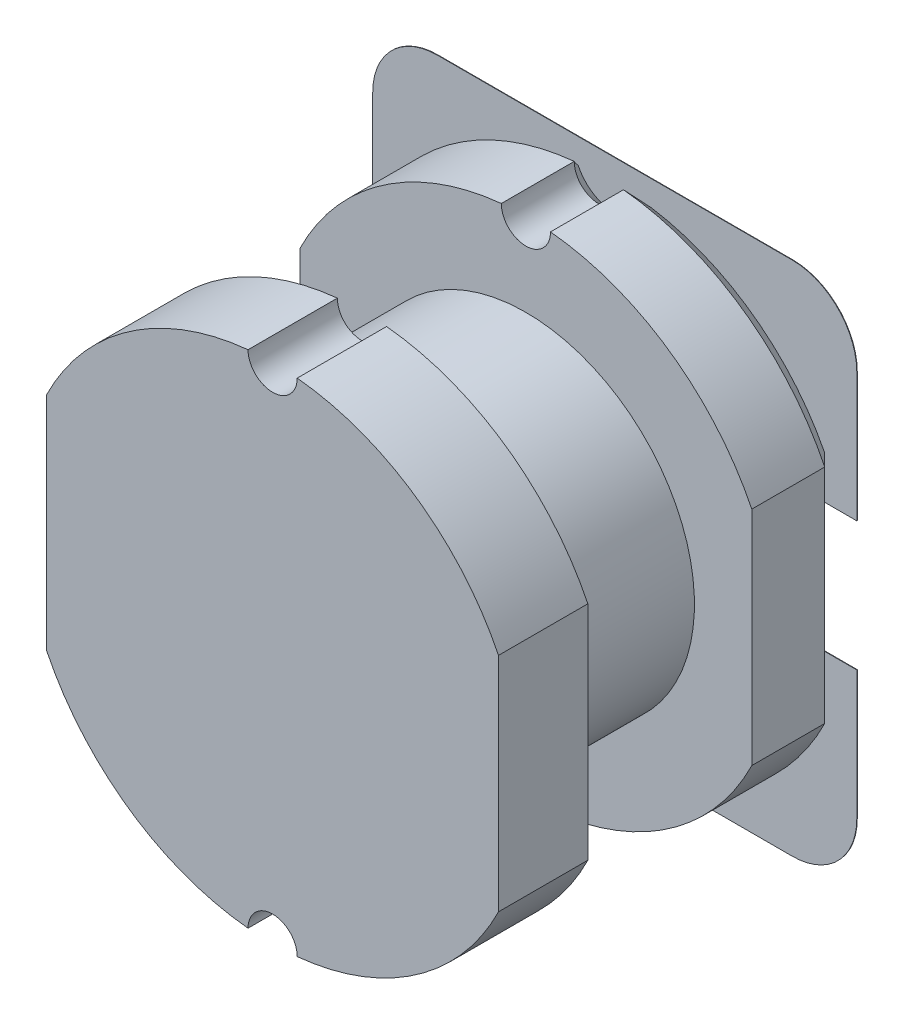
ISO-10303-21;
HEADER;
FILE_DESCRIPTION(('STEP AP214'),'2;1');
FILE_NAME('part.step','',(''),(''),'','','');
FILE_SCHEMA(('AUTOMOTIVE_DESIGN { 1 0 10303 214 1 1 1 1 }'));
ENDSEC;
DATA;
#1=APPLICATION_CONTEXT('core data for automotive mechanical design processes');
#2=APPLICATION_PROTOCOL_DEFINITION('international standard','automotive_design',2000,#1);
#3=PRODUCT_CONTEXT('',#1,'mechanical');
#4=PRODUCT('Part','Part','',(#3));
#5=PRODUCT_RELATED_PRODUCT_CATEGORY('part','',(#4));
#6=PRODUCT_DEFINITION_FORMATION('','',#4);
#7=PRODUCT_DEFINITION_CONTEXT('part definition',#1,'design');
#8=PRODUCT_DEFINITION('design','',#6,#7);
#9=PRODUCT_DEFINITION_SHAPE('','',#8);
#10=(LENGTH_UNIT() NAMED_UNIT(*) SI_UNIT(.MILLI.,.METRE.));
#11=(NAMED_UNIT(*) PLANE_ANGLE_UNIT() SI_UNIT($,.RADIAN.));
#12=(NAMED_UNIT(*) SI_UNIT($,.STERADIAN.) SOLID_ANGLE_UNIT());
#13=UNCERTAINTY_MEASURE_WITH_UNIT(LENGTH_MEASURE(1.E-05),#10,'distance_accuracy_value','');
#14=(GEOMETRIC_REPRESENTATION_CONTEXT(3) GLOBAL_UNCERTAINTY_ASSIGNED_CONTEXT((#13)) GLOBAL_UNIT_ASSIGNED_CONTEXT((#10,
#11,#12)) REPRESENTATION_CONTEXT('',''));
#15=CARTESIAN_POINT('',(0.,0.,0.));
#16=DIRECTION('',(0.,0.,1.));
#17=DIRECTION('',(1.,0.,0.));
#18=AXIS2_PLACEMENT_3D('',#15,#16,#17);
#19=CARTESIAN_POINT('',(0.,0.,0.3302));
#20=DIRECTION('',(0.,0.,1.));
#21=DIRECTION('',(1.,0.,0.));
#22=AXIS2_PLACEMENT_3D('',#19,#20,#21);
#23=PLANE('',#22);
#24=CARTESIAN_POINT('',(0.,0.,0.330200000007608));
#25=DIRECTION('',(0.,0.,-1.));
#26=DIRECTION('',(-1.,0.,0.));
#27=AXIS2_PLACEMENT_3D('',#24,#25,#26);
#28=CIRCLE('',#27,2.5400016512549);
#29=CARTESIAN_POINT('',(-2.5400016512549,0.,0.330200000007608));
#30=VERTEX_POINT('',#29);
#31=EDGE_CURVE('E249',#30,#30,#28,.T.);
#32=ORIENTED_EDGE('',*,*,#31,.T.);
#33=EDGE_LOOP('',(#32));
#34=FACE_BOUND('',#33,.T.);
#35=ADVANCED_FACE('F16',(#34),#23,.F.);
#36=CARTESIAN_POINT('',(0.,0.,0.0812800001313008));
#37=DIRECTION('',(0.,0.,-1.));
#38=DIRECTION('',(-1.,0.,0.));
#39=AXIS2_PLACEMENT_3D('',#36,#37,#38);
#40=CONICAL_SURFACE('',#39,2.78892181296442,0.785398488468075);
#41=ORIENTED_EDGE('',*,*,#31,.F.);
#42=EDGE_LOOP('',(#41));
#43=FACE_BOUND('',#42,.T.);
#44=CARTESIAN_POINT('',(0.,0.,0.0812800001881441));
#45=DIRECTION('',(0.,0.,-1.));
#46=DIRECTION('',(-1.,0.,0.));
#47=AXIS2_PLACEMENT_3D('',#44,#45,#46);
#48=CIRCLE('',#47,2.78892181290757);
#49=CARTESIAN_POINT('',(2.6034763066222,-0.99999799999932,0.0812800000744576));
#50=VERTEX_POINT('',#49);
#51=CARTESIAN_POINT('',(2.60347630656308,0.999998,0.0812800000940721));
#52=VERTEX_POINT('',#51);
#53=EDGE_CURVE('E237',#50,#52,#48,.F.);
#54=ORIENTED_EDGE('',*,*,#53,.F.);
#55=CARTESIAN_POINT('',(2.6007551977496,-0.999997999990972,0.0838200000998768));
#56=CARTESIAN_POINT('',(2.60086857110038,-0.999998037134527,0.0837141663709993));
#57=CARTESIAN_POINT('',(2.60098194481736,-0.999998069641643,0.0836083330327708));
#58=CARTESIAN_POINT('',(2.60120869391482,-0.99999812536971,0.0833966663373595));
#59=CARTESIAN_POINT('',(2.60132206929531,-0.999998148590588,0.0832908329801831));
#60=CARTESIAN_POINT('',(2.6015488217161,-0.999998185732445,0.0830791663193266));
#61=CARTESIAN_POINT('',(2.6016621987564,-0.999998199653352,0.082973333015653));
#62=CARTESIAN_POINT('',(2.6018889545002,-0.999998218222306,0.0827616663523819));
#63=CARTESIAN_POINT('',(2.60200233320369,-0.999998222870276,0.0826558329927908));
#64=CARTESIAN_POINT('',(2.60222909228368,-0.999998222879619,0.082444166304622));
#65=CARTESIAN_POINT('',(2.60234247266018,-0.999998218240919,0.0823383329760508));
#66=CARTESIAN_POINT('',(2.60256923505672,-0.999998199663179,0.082126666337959));
#67=CARTESIAN_POINT('',(2.60268261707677,-0.999998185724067,0.0820208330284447));
#68=CARTESIAN_POINT('',(2.60290938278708,-0.999998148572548,0.0818091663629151));
#69=CARTESIAN_POINT('',(2.60302276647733,-0.999998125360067,0.0817033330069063));
#70=CARTESIAN_POINT('',(2.60324953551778,-0.999998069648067,0.08149166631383));
#71=CARTESIAN_POINT('',(2.60336292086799,-0.999998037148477,0.0813858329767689));
#72=CARTESIAN_POINT('',(2.60347630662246,-0.999997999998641,0.0812800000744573));
#73=B_SPLINE_CURVE_WITH_KNOTS('',3,(#55,#56,#57,#58,#59,#60,#61,#62,#63,#64,#65,#66,#67,#68,#69,
#70,#71,#72),.UNSPECIFIED.,.F.,.F.,(4,2,2,2,2,2,2,2,4),(0.,0.000465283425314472,
0.00093057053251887,0.00139586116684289,0.00186115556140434,0.00232645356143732,
0.00279175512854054,0.00325706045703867,0.0037223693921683),.UNSPECIFIED.);
#74=CARTESIAN_POINT('',(2.60075519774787,-0.999997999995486,0.0838200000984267));
#75=VERTEX_POINT('',#74);
#76=EDGE_CURVE('E241',#75,#50,#73,.T.);
#77=ORIENTED_EDGE('',*,*,#76,.F.);
#78=CARTESIAN_POINT('',(0.,0.,0.0838200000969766));
#79=DIRECTION('',(0.,0.,-1.));
#80=DIRECTION('',(-1.,0.,0.));
#81=AXIS2_PLACEMENT_3D('',#78,#79,#80);
#82=CIRCLE('',#81,2.78638181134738);
#83=CARTESIAN_POINT('',(-2.60075519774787,-0.999997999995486,0.0838200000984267));
#84=VERTEX_POINT('',#83);
#85=EDGE_CURVE('E460',#84,#75,#82,.F.);
#86=ORIENTED_EDGE('',*,*,#85,.F.);
#87=CARTESIAN_POINT('',(-2.60347630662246,-0.99999799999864,0.0812800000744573));
#88=CARTESIAN_POINT('',(-2.60336292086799,-0.999998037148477,0.0813858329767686));
#89=CARTESIAN_POINT('',(-2.60324953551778,-0.999998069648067,0.0814916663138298));
#90=CARTESIAN_POINT('',(-2.60302276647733,-0.999998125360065,0.0817033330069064));
#91=CARTESIAN_POINT('',(-2.60290938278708,-0.999998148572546,0.0818091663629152));
#92=CARTESIAN_POINT('',(-2.60268261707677,-0.999998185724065,0.0820208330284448));
#93=CARTESIAN_POINT('',(-2.60256923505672,-0.999998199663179,0.082126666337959));
#94=CARTESIAN_POINT('',(-2.60234247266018,-0.99999821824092,0.0823383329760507));
#95=CARTESIAN_POINT('',(-2.60222909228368,-0.999998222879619,0.0824441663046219));
#96=CARTESIAN_POINT('',(-2.60200233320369,-0.999998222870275,0.0826558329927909));
#97=CARTESIAN_POINT('',(-2.6018889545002,-0.999998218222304,0.082761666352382));
#98=CARTESIAN_POINT('',(-2.6016621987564,-0.999998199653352,0.082973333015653));
#99=CARTESIAN_POINT('',(-2.6015488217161,-0.999998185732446,0.0830791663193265));
#100=CARTESIAN_POINT('',(-2.60132206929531,-0.99999814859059,0.0832908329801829));
#101=CARTESIAN_POINT('',(-2.60120869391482,-0.99999812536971,0.0833966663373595));
#102=CARTESIAN_POINT('',(-2.60098194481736,-0.99999806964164,0.0836083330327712));
#103=CARTESIAN_POINT('',(-2.60086857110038,-0.999998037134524,0.0837141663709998));
#104=CARTESIAN_POINT('',(-2.6007551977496,-0.999997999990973,0.0838200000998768));
#105=B_SPLINE_CURVE_WITH_KNOTS('',3,(#87,#88,#89,#90,#91,#92,#93,#94,#95,#96,#97,#98,#99,#100,
#101,#102,#103,#104),.UNSPECIFIED.,.F.,.F.,(4,2,2,2,2,2,2,2,4),(0.,0.000465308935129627,
0.000930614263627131,0.00139591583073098,0.00186121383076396,0.00232650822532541,
0.00279179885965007,0.00325708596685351,0.00372236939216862),.UNSPECIFIED.);
#106=CARTESIAN_POINT('',(-2.60347630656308,-0.999998,0.0812800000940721));
#107=VERTEX_POINT('',#106);
#108=EDGE_CURVE('E259',#107,#84,#105,.T.);
#109=ORIENTED_EDGE('',*,*,#108,.F.);
#110=CARTESIAN_POINT('',(0.,0.,0.0812800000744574));
#111=DIRECTION('',(0.,0.,-1.));
#112=DIRECTION('',(-1.,0.,0.));
#113=AXIS2_PLACEMENT_3D('',#110,#111,#112);
#114=CIRCLE('',#113,2.78892181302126);
#115=CARTESIAN_POINT('',(-2.6034763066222,0.99999799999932,0.0812800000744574));
#116=VERTEX_POINT('',#115);
#117=EDGE_CURVE('E19',#116,#107,#114,.F.);
#118=ORIENTED_EDGE('',*,*,#117,.F.);
#119=CARTESIAN_POINT('',(-2.6007551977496,0.999997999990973,0.0838200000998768));
#120=CARTESIAN_POINT('',(-2.60086857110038,0.999998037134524,0.0837141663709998));
#121=CARTESIAN_POINT('',(-2.60098194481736,0.99999806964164,0.0836083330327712));
#122=CARTESIAN_POINT('',(-2.60120869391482,0.99999812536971,0.0833966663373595));
#123=CARTESIAN_POINT('',(-2.60132206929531,0.99999814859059,0.0832908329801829));
#124=CARTESIAN_POINT('',(-2.6015488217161,0.999998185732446,0.0830791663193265));
#125=CARTESIAN_POINT('',(-2.6016621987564,0.999998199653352,0.0829733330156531));
#126=CARTESIAN_POINT('',(-2.6018889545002,0.999998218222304,0.0827616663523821));
#127=CARTESIAN_POINT('',(-2.60200233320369,0.999998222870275,0.0826558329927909));
#128=CARTESIAN_POINT('',(-2.60222909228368,0.999998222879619,0.0824441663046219));
#129=CARTESIAN_POINT('',(-2.60234247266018,0.99999821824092,0.0823383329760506));
#130=CARTESIAN_POINT('',(-2.60256923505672,0.999998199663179,0.082126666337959));
#131=CARTESIAN_POINT('',(-2.60268261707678,0.999998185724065,0.0820208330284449));
#132=CARTESIAN_POINT('',(-2.60290938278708,0.999998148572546,0.0818091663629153));
#133=CARTESIAN_POINT('',(-2.60302276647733,0.999998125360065,0.0817033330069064));
#134=CARTESIAN_POINT('',(-2.60324953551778,0.999998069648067,0.0814916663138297));
#135=CARTESIAN_POINT('',(-2.60336292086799,0.999998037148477,0.0813858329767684));
#136=CARTESIAN_POINT('',(-2.60347630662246,0.99999799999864,0.0812800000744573));
#137=B_SPLINE_CURVE_WITH_KNOTS('',3,(#119,#120,#121,#122,#123,#124,#125,#126,#127,#128,#129,
#130,#131,#132,#133,#134,#135,#136),.UNSPECIFIED.,.F.,.F.,(4,2,2,2,2,2,2,2,4),(0.,
0.000465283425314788,0.000930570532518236,0.00139586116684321,0.00186115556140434,
0.00232645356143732,0.00279175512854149,0.00325706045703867,0.0037223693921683),.UNSPECIFIED.);
#138=CARTESIAN_POINT('',(-2.60075519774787,0.999997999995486,0.0838200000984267));
#139=VERTEX_POINT('',#138);
#140=EDGE_CURVE('E301',#139,#116,#137,.T.);
#141=ORIENTED_EDGE('',*,*,#140,.F.);
#142=CARTESIAN_POINT('',(0.,0.,0.0838200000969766));
#143=DIRECTION('',(0.,0.,-1.));
#144=DIRECTION('',(-1.,0.,0.));
#145=AXIS2_PLACEMENT_3D('',#142,#143,#144);
#146=CIRCLE('',#145,2.78638181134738);
#147=CARTESIAN_POINT('',(2.60075519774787,0.999997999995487,0.0838200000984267));
#148=VERTEX_POINT('',#147);
#149=EDGE_CURVE('E456',#148,#139,#146,.F.);
#150=ORIENTED_EDGE('',*,*,#149,.F.);
#151=CARTESIAN_POINT('',(2.60347630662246,0.999997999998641,0.0812800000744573));
#152=CARTESIAN_POINT('',(2.60336292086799,0.999998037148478,0.0813858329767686));
#153=CARTESIAN_POINT('',(2.60324953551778,0.999998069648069,0.0814916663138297));
#154=CARTESIAN_POINT('',(2.60302276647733,0.999998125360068,0.0817033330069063));
#155=CARTESIAN_POINT('',(2.60290938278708,0.999998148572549,0.0818091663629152));
#156=CARTESIAN_POINT('',(2.60268261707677,0.999998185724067,0.0820208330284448));
#157=CARTESIAN_POINT('',(2.60256923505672,0.99999819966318,0.082126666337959));
#158=CARTESIAN_POINT('',(2.60234247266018,0.99999821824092,0.0823383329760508));
#159=CARTESIAN_POINT('',(2.60222909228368,0.99999822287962,0.082444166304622));
#160=CARTESIAN_POINT('',(2.60200233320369,0.999998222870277,0.0826558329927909));
#161=CARTESIAN_POINT('',(2.60188895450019,0.999998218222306,0.0827616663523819));
#162=CARTESIAN_POINT('',(2.6016621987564,0.999998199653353,0.0829733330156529));
#163=CARTESIAN_POINT('',(2.6015488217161,0.999998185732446,0.0830791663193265));
#164=CARTESIAN_POINT('',(2.60132206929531,0.999998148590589,0.0832908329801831));
#165=CARTESIAN_POINT('',(2.60120869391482,0.99999812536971,0.0833966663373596));
#166=CARTESIAN_POINT('',(2.60098194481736,0.999998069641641,0.083608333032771));
#167=CARTESIAN_POINT('',(2.60086857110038,0.999998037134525,0.0837141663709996));
#168=CARTESIAN_POINT('',(2.6007551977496,0.999997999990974,0.0838200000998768));
#169=B_SPLINE_CURVE_WITH_KNOTS('',3,(#151,#152,#153,#154,#155,#156,#157,#158,#159,#160,#161,
#162,#163,#164,#165,#166,#167,#168),.UNSPECIFIED.,.F.,.F.,(4,2,2,2,2,2,2,2,4),(0.,
0.000465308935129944,0.000930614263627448,0.00139591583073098,0.00186121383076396,
0.00232650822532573,0.00279179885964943,0.0032570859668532,0.0037223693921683),.UNSPECIFIED.);
#170=EDGE_CURVE('E244',#52,#148,#169,.T.);
#171=ORIENTED_EDGE('',*,*,#170,.F.);
#172=EDGE_LOOP('',(#54,#77,#86,#109,#118,#141,#150,#171));
#173=FACE_BOUND('',#172,.T.);
#174=ADVANCED_FACE('F239',(#43,#173),#40,.F.);
#175=CARTESIAN_POINT('',(0.,0.,0.08382));
#176=DIRECTION('',(0.,0.,1.));
#177=DIRECTION('',(1.,0.,0.));
#178=AXIS2_PLACEMENT_3D('',#175,#176,#177);
#179=PLANE('',#178);
#180=DIRECTION('',(1.,0.,0.));
#181=VECTOR('',#180,1.);
#182=CARTESIAN_POINT('',(3.7500052,-0.999998,0.08382));
#183=LINE('',#182,#181);
#184=EDGE_CURVE('E258',#84,#75,#183,.T.);
#185=ORIENTED_EDGE('',*,*,#184,.F.);
#186=ORIENTED_EDGE('',*,*,#85,.T.);
#187=EDGE_LOOP('',(#185,#186));
#188=FACE_BOUND('',#187,.T.);
#189=ADVANCED_FACE('F298',(#188),#179,.T.);
#190=CARTESIAN_POINT('',(0.,0.,0.08382));
#191=DIRECTION('',(0.,0.,1.));
#192=DIRECTION('',(1.,0.,0.));
#193=AXIS2_PLACEMENT_3D('',#190,#191,#192);
#194=PLANE('',#193);
#195=DIRECTION('',(1.,0.,0.));
#196=VECTOR('',#195,1.);
#197=CARTESIAN_POINT('',(-3.7500052,0.999998,0.08382));
#198=LINE('',#197,#196);
#199=EDGE_CURVE('E267',#148,#139,#198,.F.);
#200=ORIENTED_EDGE('',*,*,#199,.F.);
#201=ORIENTED_EDGE('',*,*,#149,.T.);
#202=EDGE_LOOP('',(#200,#201));
#203=FACE_BOUND('',#202,.T.);
#204=ADVANCED_FACE('F471',(#203),#194,.T.);
#205=CARTESIAN_POINT('',(3.7500052,-0.999998,0.0762));
#206=DIRECTION('',(0.,1.,0.));
#207=DIRECTION('',(0.,0.,1.));
#208=AXIS2_PLACEMENT_3D('',#205,#206,#207);
#209=PLANE('',#208);
#210=DIRECTION('',(1.,0.,0.));
#211=VECTOR('',#210,1.);
#212=CARTESIAN_POINT('',(3.7500052,-0.999998,0.08128));
#213=LINE('',#212,#211);
#214=CARTESIAN_POINT('',(3.25108000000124,-0.999998,0.0812799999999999));
#215=VERTEX_POINT('',#214);
#216=EDGE_CURVE('E256',#50,#215,#213,.T.);
#217=ORIENTED_EDGE('',*,*,#216,.T.);
#218=DIRECTION('',(0.707106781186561,0.,0.707106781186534));
#219=VECTOR('',#218,1.);
#220=CARTESIAN_POINT('',(3.25108000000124,-0.999998,0.08128));
#221=LINE('',#220,#219);
#222=CARTESIAN_POINT('',(3.25362000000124,-0.999998,0.08382));
#223=VERTEX_POINT('',#222);
#224=EDGE_CURVE('E265',#215,#223,#221,.T.);
#225=ORIENTED_EDGE('',*,*,#224,.T.);
#226=DIRECTION('',(1.,0.,0.));
#227=VECTOR('',#226,1.);
#228=CARTESIAN_POINT('',(3.7500052,-0.999998,0.08382));
#229=LINE('',#228,#227);
#230=CARTESIAN_POINT('',(3.7500052,-0.999998,0.08382));
#231=VERTEX_POINT('',#230);
#232=EDGE_CURVE('E459',#223,#231,#229,.T.);
#233=ORIENTED_EDGE('',*,*,#232,.T.);
#234=DIRECTION('',(0.,0.,1.));
#235=VECTOR('',#234,1.);
#236=CARTESIAN_POINT('',(3.7500052,-0.999998,0.0762));
#237=LINE('',#236,#235);
#238=CARTESIAN_POINT('',(3.7500052,-0.999998,0.0762));
#239=VERTEX_POINT('',#238);
#240=EDGE_CURVE('E684',#231,#239,#237,.F.);
#241=ORIENTED_EDGE('',*,*,#240,.T.);
#242=DIRECTION('',(1.,0.,0.));
#243=VECTOR('',#242,1.);
#244=CARTESIAN_POINT('',(0.,-0.999998,0.0762));
#245=LINE('',#244,#243);
#246=CARTESIAN_POINT('',(-3.7500052,-0.999998,0.0762));
#247=VERTEX_POINT('',#246);
#248=EDGE_CURVE('E652',#239,#247,#245,.F.);
#249=ORIENTED_EDGE('',*,*,#248,.T.);
#250=DIRECTION('',(0.,0.,1.));
#251=VECTOR('',#250,1.);
#252=CARTESIAN_POINT('',(-3.7500052,-0.999998,0.0762));
#253=LINE('',#252,#251);
#254=CARTESIAN_POINT('',(-3.7500052,-0.999998,0.08382));
#255=VERTEX_POINT('',#254);
#256=EDGE_CURVE('E287',#247,#255,#253,.T.);
#257=ORIENTED_EDGE('',*,*,#256,.T.);
#258=DIRECTION('',(1.,0.,0.));
#259=VECTOR('',#258,1.);
#260=CARTESIAN_POINT('',(3.7500052,-0.999998,0.08382));
#261=LINE('',#260,#259);
#262=CARTESIAN_POINT('',(-3.25362000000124,-0.999998,0.0838199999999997));
#263=VERTEX_POINT('',#262);
#264=EDGE_CURVE('E282',#255,#263,#261,.T.);
#265=ORIENTED_EDGE('',*,*,#264,.T.);
#266=DIRECTION('',(0.7071067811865,0.,-0.707106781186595));
#267=VECTOR('',#266,1.);
#268=CARTESIAN_POINT('',(-3.25362000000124,-0.999998,0.08382));
#269=LINE('',#268,#267);
#270=CARTESIAN_POINT('',(-3.25108000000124,-0.999998,0.0812799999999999));
#271=VERTEX_POINT('',#270);
#272=EDGE_CURVE('E277',#263,#271,#269,.T.);
#273=ORIENTED_EDGE('',*,*,#272,.T.);
#274=DIRECTION('',(1.,0.,0.));
#275=VECTOR('',#274,1.);
#276=CARTESIAN_POINT('',(3.7500052,-0.999998,0.08128));
#277=LINE('',#276,#275);
#278=EDGE_CURVE('E269',#271,#107,#277,.T.);
#279=ORIENTED_EDGE('',*,*,#278,.T.);
#280=ORIENTED_EDGE('',*,*,#108,.T.);
#281=ORIENTED_EDGE('',*,*,#184,.T.);
#282=ORIENTED_EDGE('',*,*,#76,.T.);
#283=EDGE_LOOP('',(#217,#225,#233,#241,#249,#257,#265,#273,#279,#280,#281,#282));
#284=FACE_BOUND('',#283,.T.);
#285=ADVANCED_FACE('F254',(#284),#209,.T.);
#286=CARTESIAN_POINT('',(-3.7500052,0.999998,0.0762));
#287=DIRECTION('',(0.,-1.,0.));
#288=DIRECTION('',(0.,0.,-1.));
#289=AXIS2_PLACEMENT_3D('',#286,#287,#288);
#290=PLANE('',#289);
#291=DIRECTION('',(1.,0.,0.));
#292=VECTOR('',#291,1.);
#293=CARTESIAN_POINT('',(-3.7500052,0.999998,0.08128));
#294=LINE('',#293,#292);
#295=CARTESIAN_POINT('',(3.25108000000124,0.999998,0.0812799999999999));
#296=VERTEX_POINT('',#295);
#297=EDGE_CURVE('E665',#296,#52,#294,.F.);
#298=ORIENTED_EDGE('',*,*,#297,.T.);
#299=ORIENTED_EDGE('',*,*,#170,.T.);
#300=ORIENTED_EDGE('',*,*,#199,.T.);
#301=ORIENTED_EDGE('',*,*,#140,.T.);
#302=DIRECTION('',(1.,0.,0.));
#303=VECTOR('',#302,1.);
#304=CARTESIAN_POINT('',(-3.7500052,0.999998,0.08128));
#305=LINE('',#304,#303);
#306=CARTESIAN_POINT('',(-3.25108000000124,0.999998,0.0812799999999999));
#307=VERTEX_POINT('',#306);
#308=EDGE_CURVE('E715',#116,#307,#305,.F.);
#309=ORIENTED_EDGE('',*,*,#308,.T.);
#310=DIRECTION('',(-0.707106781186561,0.,0.707106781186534));
#311=VECTOR('',#310,1.);
#312=CARTESIAN_POINT('',(-3.25108000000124,0.999998,0.08128));
#313=LINE('',#312,#311);
#314=CARTESIAN_POINT('',(-3.25362000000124,0.999998,0.08382));
#315=VERTEX_POINT('',#314);
#316=EDGE_CURVE('E710',#307,#315,#313,.T.);
#317=ORIENTED_EDGE('',*,*,#316,.T.);
#318=DIRECTION('',(1.,0.,0.));
#319=VECTOR('',#318,1.);
#320=CARTESIAN_POINT('',(-3.7500052,0.999998,0.08382));
#321=LINE('',#320,#319);
#322=CARTESIAN_POINT('',(-3.7500052,0.999998,0.08382));
#323=VERTEX_POINT('',#322);
#324=EDGE_CURVE('E676',#315,#323,#321,.F.);
#325=ORIENTED_EDGE('',*,*,#324,.T.);
#326=DIRECTION('',(0.,0.,-1.));
#327=VECTOR('',#326,1.);
#328=CARTESIAN_POINT('',(-3.7500052,0.999998,0.0762));
#329=LINE('',#328,#327);
#330=CARTESIAN_POINT('',(-3.7500052,0.999998,0.0762));
#331=VERTEX_POINT('',#330);
#332=EDGE_CURVE('E672',#323,#331,#329,.T.);
#333=ORIENTED_EDGE('',*,*,#332,.T.);
#334=DIRECTION('',(1.,0.,0.));
#335=VECTOR('',#334,1.);
#336=CARTESIAN_POINT('',(0.,0.999998,0.0762));
#337=LINE('',#336,#335);
#338=CARTESIAN_POINT('',(3.7500052,0.999998,0.0762));
#339=VERTEX_POINT('',#338);
#340=EDGE_CURVE('E649',#331,#339,#337,.T.);
#341=ORIENTED_EDGE('',*,*,#340,.T.);
#342=DIRECTION('',(0.,0.,-1.));
#343=VECTOR('',#342,1.);
#344=CARTESIAN_POINT('',(3.7500052,0.999998,0.0762));
#345=LINE('',#344,#343);
#346=CARTESIAN_POINT('',(3.7500052,0.999998,0.08382));
#347=VERTEX_POINT('',#346);
#348=EDGE_CURVE('E675',#339,#347,#345,.F.);
#349=ORIENTED_EDGE('',*,*,#348,.T.);
#350=DIRECTION('',(1.,0.,0.));
#351=VECTOR('',#350,1.);
#352=CARTESIAN_POINT('',(-3.7500052,0.999998,0.08382));
#353=LINE('',#352,#351);
#354=CARTESIAN_POINT('',(3.25362000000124,0.999998,0.0838199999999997));
#355=VERTEX_POINT('',#354);
#356=EDGE_CURVE('E681',#347,#355,#353,.F.);
#357=ORIENTED_EDGE('',*,*,#356,.T.);
#358=DIRECTION('',(-0.7071067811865,0.,-0.707106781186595));
#359=VECTOR('',#358,1.);
#360=CARTESIAN_POINT('',(3.25362000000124,0.999998,0.08382));
#361=LINE('',#360,#359);
#362=EDGE_CURVE('E694',#355,#296,#361,.T.);
#363=ORIENTED_EDGE('',*,*,#362,.T.);
#364=EDGE_LOOP('',(#298,#299,#300,#301,#309,#317,#325,#333,#341,#349,#357,#363));
#365=FACE_BOUND('',#364,.T.);
#366=ADVANCED_FACE('F780',(#365),#290,.T.);
#367=CARTESIAN_POINT('',(0.,0.,0.0762));
#368=DIRECTION('',(0.,0.,1.));
#369=DIRECTION('',(1.,0.,0.));
#370=AXIS2_PLACEMENT_3D('',#367,#368,#369);
#371=PLANE('',#370);
#372=CARTESIAN_POINT('',(2.75006939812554,-3.00005619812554,0.0762));
#373=DIRECTION('',(0.,0.,1.));
#374=DIRECTION('',(1.,0.,0.));
#375=AXIS2_PLACEMENT_3D('',#372,#373,#374);
#376=CIRCLE('',#375,0.999935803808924);
#377=CARTESIAN_POINT('',(2.7500072,-3.99999200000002,0.0762));
#378=VERTEX_POINT('',#377);
#379=CARTESIAN_POINT('',(3.75000520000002,-2.999994,0.0762));
#380=VERTEX_POINT('',#379);
#381=EDGE_CURVE('E448',#378,#380,#376,.T.);
#382=ORIENTED_EDGE('',*,*,#381,.F.);
#383=DIRECTION('',(1.,0.,0.));
#384=VECTOR('',#383,1.);
#385=CARTESIAN_POINT('',(-2.7500072,-3.999992,0.0762));
#386=LINE('',#385,#384);
#387=CARTESIAN_POINT('',(-2.7500072,-3.99999200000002,0.0762));
#388=VERTEX_POINT('',#387);
#389=EDGE_CURVE('E639',#388,#378,#386,.T.);
#390=ORIENTED_EDGE('',*,*,#389,.F.);
#391=CARTESIAN_POINT('',(-2.75006939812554,-3.00005619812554,0.0762));
#392=DIRECTION('',(0.,0.,1.));
#393=DIRECTION('',(1.,0.,0.));
#394=AXIS2_PLACEMENT_3D('',#391,#392,#393);
#395=CIRCLE('',#394,0.999935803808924);
#396=CARTESIAN_POINT('',(-3.75000520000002,-2.999994,0.0762));
#397=VERTEX_POINT('',#396);
#398=EDGE_CURVE('E452',#397,#388,#395,.T.);
#399=ORIENTED_EDGE('',*,*,#398,.F.);
#400=DIRECTION('',(0.,1.,0.));
#401=VECTOR('',#400,1.);
#402=CARTESIAN_POINT('',(-3.7500052,-0.999998,0.0762));
#403=LINE('',#402,#401);
#404=EDGE_CURVE('E644',#247,#397,#403,.F.);
#405=ORIENTED_EDGE('',*,*,#404,.F.);
#406=ORIENTED_EDGE('',*,*,#248,.F.);
#407=DIRECTION('',(0.,1.,0.));
#408=VECTOR('',#407,1.);
#409=CARTESIAN_POINT('',(3.7500052,-2.999994,0.0762));
#410=LINE('',#409,#408);
#411=EDGE_CURVE('E636',#380,#239,#410,.T.);
#412=ORIENTED_EDGE('',*,*,#411,.F.);
#413=EDGE_LOOP('',(#382,#390,#399,#405,#406,#412));
#414=FACE_BOUND('',#413,.T.);
#415=ADVANCED_FACE('F792',(#414),#371,.F.);
#416=CARTESIAN_POINT('',(0.,0.,0.0762));
#417=DIRECTION('',(0.,0.,1.));
#418=DIRECTION('',(1.,0.,0.));
#419=AXIS2_PLACEMENT_3D('',#416,#417,#418);
#420=PLANE('',#419);
#421=CARTESIAN_POINT('',(-2.75006939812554,3.00005619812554,0.0762));
#422=DIRECTION('',(0.,0.,1.));
#423=DIRECTION('',(1.,0.,0.));
#424=AXIS2_PLACEMENT_3D('',#421,#422,#423);
#425=CIRCLE('',#424,0.999935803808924);
#426=CARTESIAN_POINT('',(-2.7500072,3.99999200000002,0.0762));
#427=VERTEX_POINT('',#426);
#428=CARTESIAN_POINT('',(-3.75000520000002,2.999994,0.0762));
#429=VERTEX_POINT('',#428);
#430=EDGE_CURVE('E440',#427,#429,#425,.T.);
#431=ORIENTED_EDGE('',*,*,#430,.F.);
#432=DIRECTION('',(1.,0.,0.));
#433=VECTOR('',#432,1.);
#434=CARTESIAN_POINT('',(2.7500072,3.999992,0.0762));
#435=LINE('',#434,#433);
#436=CARTESIAN_POINT('',(2.7500072,3.99999200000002,0.0762));
#437=VERTEX_POINT('',#436);
#438=EDGE_CURVE('E628',#437,#427,#435,.F.);
#439=ORIENTED_EDGE('',*,*,#438,.F.);
#440=CARTESIAN_POINT('',(2.75006939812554,3.00005619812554,0.0762));
#441=DIRECTION('',(0.,0.,1.));
#442=DIRECTION('',(1.,0.,0.));
#443=AXIS2_PLACEMENT_3D('',#440,#441,#442);
#444=CIRCLE('',#443,0.999935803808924);
#445=CARTESIAN_POINT('',(3.75000520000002,2.999994,0.0762));
#446=VERTEX_POINT('',#445);
#447=EDGE_CURVE('E444',#446,#437,#444,.T.);
#448=ORIENTED_EDGE('',*,*,#447,.F.);
#449=DIRECTION('',(0.,1.,0.));
#450=VECTOR('',#449,1.);
#451=CARTESIAN_POINT('',(3.7500052,0.999998,0.0762));
#452=LINE('',#451,#450);
#453=EDGE_CURVE('E633',#339,#446,#452,.T.);
#454=ORIENTED_EDGE('',*,*,#453,.F.);
#455=ORIENTED_EDGE('',*,*,#340,.F.);
#456=DIRECTION('',(0.,1.,0.));
#457=VECTOR('',#456,1.);
#458=CARTESIAN_POINT('',(-3.7500052,2.999994,0.0762));
#459=LINE('',#458,#457);
#460=EDGE_CURVE('E618',#429,#331,#459,.F.);
#461=ORIENTED_EDGE('',*,*,#460,.F.);
#462=EDGE_LOOP('',(#431,#439,#448,#454,#455,#461));
#463=FACE_BOUND('',#462,.T.);
#464=ADVANCED_FACE('F795',(#463),#420,.F.);
#465=CARTESIAN_POINT('',(-3.7500052,-0.999998,0.0762));
#466=DIRECTION('',(-1.,0.,0.));
#467=DIRECTION('',(0.,0.,1.));
#468=AXIS2_PLACEMENT_3D('',#465,#466,#467);
#469=PLANE('',#468);
#470=ORIENTED_EDGE('',*,*,#256,.F.);
#471=ORIENTED_EDGE('',*,*,#404,.T.);
#472=DIRECTION('',(0.,0.,1.));
#473=VECTOR('',#472,1.);
#474=CARTESIAN_POINT('',(-3.75000520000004,-2.999994,0.0762));
#475=LINE('',#474,#473);
#476=CARTESIAN_POINT('',(-3.75000520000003,-2.999994,0.08382));
#477=VERTEX_POINT('',#476);
#478=EDGE_CURVE('E455',#477,#397,#475,.F.);
#479=ORIENTED_EDGE('',*,*,#478,.F.);
#480=DIRECTION('',(0.,1.,0.));
#481=VECTOR('',#480,1.);
#482=CARTESIAN_POINT('',(-3.7500052,0.,0.08382));
#483=LINE('',#482,#481);
#484=EDGE_CURVE('E439',#255,#477,#483,.F.);
#485=ORIENTED_EDGE('',*,*,#484,.F.);
#486=EDGE_LOOP('',(#470,#471,#479,#485));
#487=FACE_BOUND('',#486,.T.);
#488=ADVANCED_FACE('F799',(#487),#469,.T.);
#489=CARTESIAN_POINT('',(-2.75006939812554,-3.00005619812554,0.0762));
#490=DIRECTION('',(0.,0.,1.));
#491=DIRECTION('',(1.,0.,0.));
#492=AXIS2_PLACEMENT_3D('',#489,#490,#491);
#493=CYLINDRICAL_SURFACE('',#492,0.999935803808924);
#494=ORIENTED_EDGE('',*,*,#478,.T.);
#495=ORIENTED_EDGE('',*,*,#398,.T.);
#496=DIRECTION('',(0.,0.,-1.));
#497=VECTOR('',#496,1.);
#498=CARTESIAN_POINT('',(-2.7500072,-3.999992,0.0762));
#499=LINE('',#498,#497);
#500=CARTESIAN_POINT('',(-2.7500072,-3.999992,0.08382));
#501=VERTEX_POINT('',#500);
#502=EDGE_CURVE('E454',#501,#388,#499,.T.);
#503=ORIENTED_EDGE('',*,*,#502,.F.);
#504=CARTESIAN_POINT('',(-2.75006939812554,-3.00005619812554,0.08382));
#505=DIRECTION('',(0.,0.,1.));
#506=DIRECTION('',(1.,0.,0.));
#507=AXIS2_PLACEMENT_3D('',#504,#505,#506);
#508=CIRCLE('',#507,0.999935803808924);
#509=EDGE_CURVE('E436',#477,#501,#508,.T.);
#510=ORIENTED_EDGE('',*,*,#509,.F.);
#511=EDGE_LOOP('',(#494,#495,#503,#510));
#512=FACE_BOUND('',#511,.T.);
#513=ADVANCED_FACE('F803',(#512),#493,.T.);
#514=CARTESIAN_POINT('',(-2.7500072,-3.999992,0.0762));
#515=DIRECTION('',(0.,-1.,0.));
#516=DIRECTION('',(0.,0.,-1.));
#517=AXIS2_PLACEMENT_3D('',#514,#515,#516);
#518=PLANE('',#517);
#519=ORIENTED_EDGE('',*,*,#502,.T.);
#520=ORIENTED_EDGE('',*,*,#389,.T.);
#521=DIRECTION('',(0.,0.,1.));
#522=VECTOR('',#521,1.);
#523=CARTESIAN_POINT('',(2.7500072,-3.99999200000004,0.0762));
#524=LINE('',#523,#522);
#525=CARTESIAN_POINT('',(2.7500072,-3.99999200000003,0.08382));
#526=VERTEX_POINT('',#525);
#527=EDGE_CURVE('E451',#526,#378,#524,.F.);
#528=ORIENTED_EDGE('',*,*,#527,.F.);
#529=DIRECTION('',(1.,0.,0.));
#530=VECTOR('',#529,1.);
#531=CARTESIAN_POINT('',(0.,-3.999992,0.08382));
#532=LINE('',#531,#530);
#533=EDGE_CURVE('E435',#501,#526,#532,.T.);
#534=ORIENTED_EDGE('',*,*,#533,.F.);
#535=EDGE_LOOP('',(#519,#520,#528,#534));
#536=FACE_BOUND('',#535,.T.);
#537=ADVANCED_FACE('F806',(#536),#518,.T.);
#538=CARTESIAN_POINT('',(2.75006939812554,-3.00005619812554,0.0762));
#539=DIRECTION('',(0.,0.,1.));
#540=DIRECTION('',(1.,0.,0.));
#541=AXIS2_PLACEMENT_3D('',#538,#539,#540);
#542=CYLINDRICAL_SURFACE('',#541,0.999935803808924);
#543=ORIENTED_EDGE('',*,*,#527,.T.);
#544=ORIENTED_EDGE('',*,*,#381,.T.);
#545=DIRECTION('',(0.,0.,-1.));
#546=VECTOR('',#545,1.);
#547=CARTESIAN_POINT('',(3.7500052,-2.999994,0.0762));
#548=LINE('',#547,#546);
#549=CARTESIAN_POINT('',(3.7500052,-2.999994,0.08382));
#550=VERTEX_POINT('',#549);
#551=EDGE_CURVE('E450',#550,#380,#548,.T.);
#552=ORIENTED_EDGE('',*,*,#551,.F.);
#553=CARTESIAN_POINT('',(2.75006939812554,-3.00005619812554,0.08382));
#554=DIRECTION('',(0.,0.,1.));
#555=DIRECTION('',(1.,0.,0.));
#556=AXIS2_PLACEMENT_3D('',#553,#554,#555);
#557=CIRCLE('',#556,0.999935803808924);
#558=EDGE_CURVE('E431',#526,#550,#557,.T.);
#559=ORIENTED_EDGE('',*,*,#558,.F.);
#560=EDGE_LOOP('',(#543,#544,#552,#559));
#561=FACE_BOUND('',#560,.T.);
#562=ADVANCED_FACE('F810',(#561),#542,.T.);
#563=CARTESIAN_POINT('',(3.7500052,-2.999994,0.0762));
#564=DIRECTION('',(1.,0.,0.));
#565=DIRECTION('',(0.,0.,-1.));
#566=AXIS2_PLACEMENT_3D('',#563,#564,#565);
#567=PLANE('',#566);
#568=ORIENTED_EDGE('',*,*,#551,.T.);
#569=ORIENTED_EDGE('',*,*,#411,.T.);
#570=ORIENTED_EDGE('',*,*,#240,.F.);
#571=DIRECTION('',(0.,1.,0.));
#572=VECTOR('',#571,1.);
#573=CARTESIAN_POINT('',(3.7500052,0.,0.08382));
#574=LINE('',#573,#572);
#575=EDGE_CURVE('E434',#550,#231,#574,.T.);
#576=ORIENTED_EDGE('',*,*,#575,.F.);
#577=EDGE_LOOP('',(#568,#569,#570,#576));
#578=FACE_BOUND('',#577,.T.);
#579=ADVANCED_FACE('F814',(#578),#567,.T.);
#580=CARTESIAN_POINT('',(3.7500052,0.999998,0.0762));
#581=DIRECTION('',(1.,0.,0.));
#582=DIRECTION('',(0.,0.,-1.));
#583=AXIS2_PLACEMENT_3D('',#580,#581,#582);
#584=PLANE('',#583);
#585=ORIENTED_EDGE('',*,*,#348,.F.);
#586=ORIENTED_EDGE('',*,*,#453,.T.);
#587=DIRECTION('',(0.,0.,1.));
#588=VECTOR('',#587,1.);
#589=CARTESIAN_POINT('',(3.75000520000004,2.999994,0.0762));
#590=LINE('',#589,#588);
#591=CARTESIAN_POINT('',(3.75000520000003,2.999994,0.08382));
#592=VERTEX_POINT('',#591);
#593=EDGE_CURVE('E447',#592,#446,#590,.F.);
#594=ORIENTED_EDGE('',*,*,#593,.F.);
#595=DIRECTION('',(0.,1.,0.));
#596=VECTOR('',#595,1.);
#597=CARTESIAN_POINT('',(3.7500052,0.,0.08382));
#598=LINE('',#597,#596);
#599=EDGE_CURVE('E430',#347,#592,#598,.T.);
#600=ORIENTED_EDGE('',*,*,#599,.F.);
#601=EDGE_LOOP('',(#585,#586,#594,#600));
#602=FACE_BOUND('',#601,.T.);
#603=ADVANCED_FACE('F818',(#602),#584,.T.);
#604=CARTESIAN_POINT('',(2.75006939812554,3.00005619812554,0.0762));
#605=DIRECTION('',(0.,0.,1.));
#606=DIRECTION('',(1.,0.,0.));
#607=AXIS2_PLACEMENT_3D('',#604,#605,#606);
#608=CYLINDRICAL_SURFACE('',#607,0.999935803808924);
#609=ORIENTED_EDGE('',*,*,#593,.T.);
#610=ORIENTED_EDGE('',*,*,#447,.T.);
#611=DIRECTION('',(0.,0.,1.));
#612=VECTOR('',#611,1.);
#613=CARTESIAN_POINT('',(2.7500072,3.999992,0.0762));
#614=LINE('',#613,#612);
#615=CARTESIAN_POINT('',(2.7500072,3.999992,0.08382));
#616=VERTEX_POINT('',#615);
#617=EDGE_CURVE('E446',#616,#437,#614,.F.);
#618=ORIENTED_EDGE('',*,*,#617,.F.);
#619=CARTESIAN_POINT('',(2.75006939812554,3.00005619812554,0.08382));
#620=DIRECTION('',(0.,0.,1.));
#621=DIRECTION('',(1.,0.,0.));
#622=AXIS2_PLACEMENT_3D('',#619,#620,#621);
#623=CIRCLE('',#622,0.999935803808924);
#624=EDGE_CURVE('E427',#592,#616,#623,.T.);
#625=ORIENTED_EDGE('',*,*,#624,.F.);
#626=EDGE_LOOP('',(#609,#610,#618,#625));
#627=FACE_BOUND('',#626,.T.);
#628=ADVANCED_FACE('F822',(#627),#608,.T.);
#629=CARTESIAN_POINT('',(2.7500072,3.999992,0.0762));
#630=DIRECTION('',(0.,1.,0.));
#631=DIRECTION('',(0.,0.,1.));
#632=AXIS2_PLACEMENT_3D('',#629,#630,#631);
#633=PLANE('',#632);
#634=ORIENTED_EDGE('',*,*,#617,.T.);
#635=ORIENTED_EDGE('',*,*,#438,.T.);
#636=DIRECTION('',(0.,0.,1.));
#637=VECTOR('',#636,1.);
#638=CARTESIAN_POINT('',(-2.7500072,3.99999200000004,0.0762));
#639=LINE('',#638,#637);
#640=CARTESIAN_POINT('',(-2.7500072,3.99999200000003,0.08382));
#641=VERTEX_POINT('',#640);
#642=EDGE_CURVE('E443',#641,#427,#639,.F.);
#643=ORIENTED_EDGE('',*,*,#642,.F.);
#644=DIRECTION('',(1.,0.,0.));
#645=VECTOR('',#644,1.);
#646=CARTESIAN_POINT('',(0.,3.999992,0.08382));
#647=LINE('',#646,#645);
#648=EDGE_CURVE('E426',#616,#641,#647,.F.);
#649=ORIENTED_EDGE('',*,*,#648,.F.);
#650=EDGE_LOOP('',(#634,#635,#643,#649));
#651=FACE_BOUND('',#650,.T.);
#652=ADVANCED_FACE('F826',(#651),#633,.T.);
#653=CARTESIAN_POINT('',(-2.75006939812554,3.00005619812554,0.0762));
#654=DIRECTION('',(0.,0.,1.));
#655=DIRECTION('',(1.,0.,0.));
#656=AXIS2_PLACEMENT_3D('',#653,#654,#655);
#657=CYLINDRICAL_SURFACE('',#656,0.999935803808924);
#658=ORIENTED_EDGE('',*,*,#642,.T.);
#659=ORIENTED_EDGE('',*,*,#430,.T.);
#660=DIRECTION('',(0.,0.,1.));
#661=VECTOR('',#660,1.);
#662=CARTESIAN_POINT('',(-3.7500052,2.999994,0.0762));
#663=LINE('',#662,#661);
#664=CARTESIAN_POINT('',(-3.7500052,2.999994,0.08382));
#665=VERTEX_POINT('',#664);
#666=EDGE_CURVE('E442',#665,#429,#663,.F.);
#667=ORIENTED_EDGE('',*,*,#666,.F.);
#668=CARTESIAN_POINT('',(-2.75006939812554,3.00005619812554,0.08382));
#669=DIRECTION('',(0.,0.,1.));
#670=DIRECTION('',(1.,0.,0.));
#671=AXIS2_PLACEMENT_3D('',#668,#669,#670);
#672=CIRCLE('',#671,0.999935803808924);
#673=EDGE_CURVE('E422',#641,#665,#672,.T.);
#674=ORIENTED_EDGE('',*,*,#673,.F.);
#675=EDGE_LOOP('',(#658,#659,#667,#674));
#676=FACE_BOUND('',#675,.T.);
#677=ADVANCED_FACE('F830',(#676),#657,.T.);
#678=CARTESIAN_POINT('',(-3.7500052,2.999994,0.0762));
#679=DIRECTION('',(-1.,0.,0.));
#680=DIRECTION('',(0.,0.,1.));
#681=AXIS2_PLACEMENT_3D('',#678,#679,#680);
#682=PLANE('',#681);
#683=ORIENTED_EDGE('',*,*,#666,.T.);
#684=ORIENTED_EDGE('',*,*,#460,.T.);
#685=ORIENTED_EDGE('',*,*,#332,.F.);
#686=DIRECTION('',(0.,1.,0.));
#687=VECTOR('',#686,1.);
#688=CARTESIAN_POINT('',(-3.7500052,0.,0.08382));
#689=LINE('',#688,#687);
#690=EDGE_CURVE('E425',#665,#323,#689,.F.);
#691=ORIENTED_EDGE('',*,*,#690,.F.);
#692=EDGE_LOOP('',(#683,#684,#685,#691));
#693=FACE_BOUND('',#692,.T.);
#694=ADVANCED_FACE('F834',(#693),#682,.T.);
#695=CARTESIAN_POINT('',(0.,0.,0.08128));
#696=DIRECTION('',(0.,0.,-1.));
#697=DIRECTION('',(-1.,0.,0.));
#698=AXIS2_PLACEMENT_3D('',#695,#696,#697);
#699=PLANE('',#698);
#700=ORIENTED_EDGE('',*,*,#216,.F.);
#701=ORIENTED_EDGE('',*,*,#53,.T.);
#702=ORIENTED_EDGE('',*,*,#297,.F.);
#703=DIRECTION('',(0.,1.,0.));
#704=VECTOR('',#703,1.);
#705=CARTESIAN_POINT('',(3.25108000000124,0.,0.0812799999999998));
#706=LINE('',#705,#704);
#707=EDGE_CURVE('E264',#215,#296,#706,.T.);
#708=ORIENTED_EDGE('',*,*,#707,.F.);
#709=EDGE_LOOP('',(#700,#701,#702,#708));
#710=FACE_BOUND('',#709,.T.);
#711=ADVANCED_FACE('F262',(#710),#699,.T.);
#712=CARTESIAN_POINT('',(0.,0.,0.08382));
#713=DIRECTION('',(0.,0.,1.));
#714=DIRECTION('',(1.,0.,0.));
#715=AXIS2_PLACEMENT_3D('',#712,#713,#714);
#716=PLANE('',#715);
#717=CARTESIAN_POINT('',(0.,0.,0.0838199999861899));
#718=DIRECTION('',(0.,0.,1.));
#719=DIRECTION('',(1.,0.,0.));
#720=AXIS2_PLACEMENT_3D('',#717,#718,#719);
#721=CIRCLE('',#720,3.65362041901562);
#722=CARTESIAN_POINT('',(-3.25362000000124,-1.66219705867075,0.083819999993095));
#723=VERTEX_POINT('',#722);
#724=CARTESIAN_POINT('',(-0.565464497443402,-3.60959721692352,0.0838199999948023));
#725=VERTEX_POINT('',#724);
#726=EDGE_CURVE('E895',#723,#725,#721,.T.);
#727=ORIENTED_EDGE('',*,*,#726,.F.);
#728=DIRECTION('',(0.,1.,0.));
#729=VECTOR('',#728,1.);
#730=CARTESIAN_POINT('',(-3.25362000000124,0.,0.08382));
#731=LINE('',#730,#729);
#732=EDGE_CURVE('E593',#723,#263,#731,.T.);
#733=ORIENTED_EDGE('',*,*,#732,.T.);
#734=ORIENTED_EDGE('',*,*,#264,.F.);
#735=ORIENTED_EDGE('',*,*,#484,.T.);
#736=ORIENTED_EDGE('',*,*,#509,.T.);
#737=ORIENTED_EDGE('',*,*,#533,.T.);
#738=ORIENTED_EDGE('',*,*,#558,.T.);
#739=ORIENTED_EDGE('',*,*,#575,.T.);
#740=ORIENTED_EDGE('',*,*,#232,.F.);
#741=DIRECTION('',(0.,1.,0.));
#742=VECTOR('',#741,1.);
#743=CARTESIAN_POINT('',(3.25362000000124,0.,0.0838199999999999));
#744=LINE('',#743,#742);
#745=CARTESIAN_POINT('',(3.25361999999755,-1.66219698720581,0.0838199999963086));
#746=VERTEX_POINT('',#745);
#747=EDGE_CURVE('E586',#746,#223,#744,.T.);
#748=ORIENTED_EDGE('',*,*,#747,.F.);
#749=CARTESIAN_POINT('',(0.,0.,0.0838199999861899));
#750=DIRECTION('',(0.,0.,1.));
#751=DIRECTION('',(1.,0.,0.));
#752=AXIS2_PLACEMENT_3D('',#749,#750,#751);
#753=CIRCLE('',#752,3.65362038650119);
#754=CARTESIAN_POINT('',(0.56546448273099,-3.60959718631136,0.0838199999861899));
#755=VERTEX_POINT('',#754);
#756=EDGE_CURVE('E419',#755,#746,#753,.T.);
#757=ORIENTED_EDGE('',*,*,#756,.F.);
#758=CARTESIAN_POINT('',(0.,-3.88134499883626,0.0838199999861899));
#759=DIRECTION('',(0.,0.,-1.));
#760=DIRECTION('',(-1.,0.,0.));
#761=AXIS2_PLACEMENT_3D('',#758,#759,#760);
#762=CIRCLE('',#761,0.627373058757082);
#763=EDGE_CURVE('E900',#755,#725,#762,.F.);
#764=ORIENTED_EDGE('',*,*,#763,.T.);
#765=EDGE_LOOP('',(#727,#733,#734,#735,#736,#737,#738,#739,#740,#748,#757,#764));
#766=FACE_BOUND('',#765,.T.);
#767=ADVANCED_FACE('F740',(#766),#716,.T.);
#768=CARTESIAN_POINT('',(0.,0.,0.08128));
#769=DIRECTION('',(0.,0.,-1.));
#770=DIRECTION('',(-1.,0.,0.));
#771=AXIS2_PLACEMENT_3D('',#768,#769,#770);
#772=PLANE('',#771);
#773=ORIENTED_EDGE('',*,*,#308,.F.);
#774=ORIENTED_EDGE('',*,*,#117,.T.);
#775=ORIENTED_EDGE('',*,*,#278,.F.);
#776=DIRECTION('',(0.,1.,0.));
#777=VECTOR('',#776,1.);
#778=CARTESIAN_POINT('',(-3.25108000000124,0.,0.0812799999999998));
#779=LINE('',#778,#777);
#780=EDGE_CURVE('E602',#307,#271,#779,.F.);
#781=ORIENTED_EDGE('',*,*,#780,.F.);
#782=EDGE_LOOP('',(#773,#774,#775,#781));
#783=FACE_BOUND('',#782,.T.);
#784=ADVANCED_FACE('F779',(#783),#772,.T.);
#785=CARTESIAN_POINT('',(0.,0.,0.08382));
#786=DIRECTION('',(0.,0.,1.));
#787=DIRECTION('',(1.,0.,0.));
#788=AXIS2_PLACEMENT_3D('',#785,#786,#787);
#789=PLANE('',#788);
#790=DIRECTION('',(0.,1.,0.));
#791=VECTOR('',#790,1.);
#792=CARTESIAN_POINT('',(-3.25362000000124,0.,0.0838199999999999));
#793=LINE('',#792,#791);
#794=CARTESIAN_POINT('',(-3.25362000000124,1.66219705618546,0.083819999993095));
#795=VERTEX_POINT('',#794);
#796=EDGE_CURVE('E599',#795,#315,#793,.F.);
#797=ORIENTED_EDGE('',*,*,#796,.F.);
#798=CARTESIAN_POINT('',(0.,0.,0.08381999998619));
#799=DIRECTION('',(0.,0.,1.));
#800=DIRECTION('',(1.,0.,0.));
#801=AXIS2_PLACEMENT_3D('',#798,#799,#800);
#802=CIRCLE('',#801,3.65362041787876);
#803=CARTESIAN_POINT('',(-0.565465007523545,3.60959713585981,0.0838199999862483));
#804=VERTEX_POINT('',#803);
#805=EDGE_CURVE('E849',#804,#795,#802,.T.);
#806=ORIENTED_EDGE('',*,*,#805,.F.);
#807=CARTESIAN_POINT('',(0.,3.88134499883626,0.0838199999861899));
#808=DIRECTION('',(0.,0.,-1.));
#809=DIRECTION('',(-1.,0.,0.));
#810=AXIS2_PLACEMENT_3D('',#807,#808,#809);
#811=CIRCLE('',#810,0.627373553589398);
#812=CARTESIAN_POINT('',(0.565464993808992,3.60959710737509,0.0838199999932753));
#813=VERTEX_POINT('',#812);
#814=EDGE_CURVE('E863',#804,#813,#811,.F.);
#815=ORIENTED_EDGE('',*,*,#814,.T.);
#816=CARTESIAN_POINT('',(0.,0.,0.0838200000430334));
#817=DIRECTION('',(0.,0.,1.));
#818=DIRECTION('',(1.,0.,0.));
#819=AXIS2_PLACEMENT_3D('',#816,#817,#818);
#820=CIRCLE('',#819,3.65362038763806);
#821=CARTESIAN_POINT('',(3.25362000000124,1.66219698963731,0.0838200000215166));
#822=VERTEX_POINT('',#821);
#823=EDGE_CURVE('E378',#822,#813,#820,.T.);
#824=ORIENTED_EDGE('',*,*,#823,.F.);
#825=DIRECTION('',(0.,1.,0.));
#826=VECTOR('',#825,1.);
#827=CARTESIAN_POINT('',(3.25362000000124,0.,0.0838199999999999));
#828=LINE('',#827,#826);
#829=EDGE_CURVE('E420',#355,#822,#828,.T.);
#830=ORIENTED_EDGE('',*,*,#829,.F.);
#831=ORIENTED_EDGE('',*,*,#356,.F.);
#832=ORIENTED_EDGE('',*,*,#599,.T.);
#833=ORIENTED_EDGE('',*,*,#624,.T.);
#834=ORIENTED_EDGE('',*,*,#648,.T.);
#835=ORIENTED_EDGE('',*,*,#673,.T.);
#836=ORIENTED_EDGE('',*,*,#690,.T.);
#837=ORIENTED_EDGE('',*,*,#324,.F.);
#838=EDGE_LOOP('',(#797,#806,#815,#824,#830,#831,#832,#833,#834,#835,#836,#837));
#839=FACE_BOUND('',#838,.T.);
#840=ADVANCED_FACE('F405',(#839),#789,.T.);
#841=CARTESIAN_POINT('',(3.37300000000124,0.,0.2032));
#842=DIRECTION('',(0.707106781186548,0.,-0.707106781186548));
#843=DIRECTION('',(-0.707106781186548,0.,-0.707106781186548));
#844=AXIS2_PLACEMENT_3D('',#841,#842,#843);
#845=PLANE('',#844);
#846=ORIENTED_EDGE('',*,*,#362,.F.);
#847=ORIENTED_EDGE('',*,*,#829,.T.);
#848=CARTESIAN_POINT('',(3.49999982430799,1.72046595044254,0.330199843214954));
#849=CARTESIAN_POINT('',(3.45891728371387,1.71091718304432,0.289117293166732));
#850=CARTESIAN_POINT('',(3.41784436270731,1.70128705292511,0.248044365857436));
#851=CARTESIAN_POINT('',(3.33571775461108,1.68186406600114,0.165917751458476));
#852=CARTESIAN_POINT('',(3.29466406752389,1.67207120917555,0.124864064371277));
#853=CARTESIAN_POINT('',(3.25362000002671,1.66219698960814,0.0838200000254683));
#854=B_SPLINE_CURVE_WITH_KNOTS('',3,(#848,#849,#850,#851,#852,#853),.UNSPECIFIED.,.F.,.F.,(4,2,
4),(0.,0.176636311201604,0.353272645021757),.UNSPECIFIED.);
#855=CARTESIAN_POINT('',(3.49999991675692,1.72046550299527,0.330199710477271));
#856=VERTEX_POINT('',#855);
#857=EDGE_CURVE('E382',#856,#822,#854,.T.);
#858=ORIENTED_EDGE('',*,*,#857,.F.);
#859=DIRECTION('',(0.,1.,0.));
#860=VECTOR('',#859,1.);
#861=CARTESIAN_POINT('',(3.50000000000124,-1.72046505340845,0.330199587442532));
#862=LINE('',#861,#860);
#863=CARTESIAN_POINT('',(3.50000000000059,-1.7204650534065,0.330197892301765));
#864=VERTEX_POINT('',#863);
#865=EDGE_CURVE('E381',#864,#856,#862,.T.);
#866=ORIENTED_EDGE('',*,*,#865,.F.);
#867=CARTESIAN_POINT('',(3.25361999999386,-1.66219698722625,0.0838199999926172));
#868=CARTESIAN_POINT('',(3.29466379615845,-1.67207114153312,0.124863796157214));
#869=CARTESIAN_POINT('',(3.33571721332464,-1.68186393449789,0.1659172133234));
#870=CARTESIAN_POINT('',(3.41784328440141,-1.70128679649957,0.248043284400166));
#871=CARTESIAN_POINT('',(3.45891593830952,-1.71091686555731,0.289115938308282));
#872=CARTESIAN_POINT('',(3.49999821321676,-1.7204655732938,0.330198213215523));
#873=B_SPLINE_CURVE_WITH_KNOTS('',3,(#867,#868,#869,#870,#871,#872),.UNSPECIFIED.,.F.,.F.,(4,2,
4),(0.,0.176635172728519,0.353270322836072),.UNSPECIFIED.);
#874=EDGE_CURVE('E412',#746,#864,#873,.T.);
#875=ORIENTED_EDGE('',*,*,#874,.F.);
#876=ORIENTED_EDGE('',*,*,#747,.T.);
#877=ORIENTED_EDGE('',*,*,#224,.F.);
#878=ORIENTED_EDGE('',*,*,#707,.T.);
#879=EDGE_LOOP('',(#846,#847,#858,#866,#875,#876,#877,#878));
#880=FACE_BOUND('',#879,.T.);
#881=ADVANCED_FACE('F399',(#880),#845,.T.);
#882=CARTESIAN_POINT('',(0.,0.,0.330199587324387));
#883=DIRECTION('',(0.,0.,1.));
#884=DIRECTION('',(1.,0.,0.));
#885=AXIS2_PLACEMENT_3D('',#882,#883,#884);
#886=CONICAL_SURFACE('',#885,3.89999999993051,0.785398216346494);
#887=CARTESIAN_POINT('',(0.38099827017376,-3.88134308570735,0.330196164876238));
#888=CARTESIAN_POINT('',(0.400137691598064,-3.86018204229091,0.311011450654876));
#889=CARTESIAN_POINT('',(0.418109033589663,-3.83847447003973,0.291330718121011));
#890=CARTESIAN_POINT('',(0.452033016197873,-3.79428962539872,0.251270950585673));
#891=CARTESIAN_POINT('',(0.467991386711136,-3.77181478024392,0.2308941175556));
#892=CARTESIAN_POINT('',(0.498289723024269,-3.72632906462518,0.189654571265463));
#893=CARTESIAN_POINT('',(0.512632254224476,-3.7033191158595,0.168792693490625));
#894=CARTESIAN_POINT('',(0.539996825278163,-3.65679134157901,0.126608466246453));
#895=CARTESIAN_POINT('',(0.553014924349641,-3.63327223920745,0.105284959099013));
#896=CARTESIAN_POINT('',(0.565464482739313,-3.60959718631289,0.083819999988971));
#897=B_SPLINE_CURVE_WITH_KNOTS('',3,(#887,#888,#889,#890,#891,#892,#893,#894,#895,#896),
.UNSPECIFIED.,.F.,.F.,(4,2,2,2,4),(0.,0.103066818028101,0.205833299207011,0.308434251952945,
0.411332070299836),.UNSPECIFIED.);
#898=CARTESIAN_POINT('',(0.380999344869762,-3.88134381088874,0.330196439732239));
#899=VERTEX_POINT('',#898);
#900=EDGE_CURVE('E896',#899,#755,#897,.T.);
#901=ORIENTED_EDGE('',*,*,#900,.T.);
#902=ORIENTED_EDGE('',*,*,#756,.T.);
#903=ORIENTED_EDGE('',*,*,#874,.T.);
#904=CARTESIAN_POINT('',(0.,0.,0.330195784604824));
#905=DIRECTION('',(0.,0.,1.));
#906=DIRECTION('',(1.,0.,0.));
#907=AXIS2_PLACEMENT_3D('',#904,#905,#906);
#908=CIRCLE('',#907,3.89999999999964);
#909=EDGE_CURVE('E567',#899,#864,#908,.T.);
#910=ORIENTED_EDGE('',*,*,#909,.F.);
#911=EDGE_LOOP('',(#901,#902,#903,#910));
#912=FACE_BOUND('',#911,.T.);
#913=ADVANCED_FACE('F404',(#912),#886,.T.);
#914=CARTESIAN_POINT('',(0.,-3.88134499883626,0.0838199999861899));
#915=DIRECTION('',(0.,0.,-1.));
#916=DIRECTION('',(-1.,0.,0.));
#917=AXIS2_PLACEMENT_3D('',#914,#915,#916);
#918=CONICAL_SURFACE('',#917,0.627373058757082,0.785392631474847);
#919=CARTESIAN_POINT('',(0.,-3.88134499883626,0.330195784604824));
#920=DIRECTION('',(0.,0.,1.));
#921=DIRECTION('',(1.,0.,0.));
#922=AXIS2_PLACEMENT_3D('',#919,#920,#921);
#923=CIRCLE('',#922,0.381);
#924=CARTESIAN_POINT('',(-0.381000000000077,-3.88134499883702,0.330197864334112));
#925=VERTEX_POINT('',#924);
#926=EDGE_CURVE('E579',#899,#925,#923,.T.);
#927=ORIENTED_EDGE('',*,*,#926,.T.);
#928=CARTESIAN_POINT('',(-0.565464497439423,-3.609597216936,0.0838200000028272));
#929=CARTESIAN_POINT('',(-0.553014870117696,-3.63327238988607,0.105285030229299));
#930=CARTESIAN_POINT('',(-0.539996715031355,-3.65679159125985,0.126608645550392));
#931=CARTESIAN_POINT('',(-0.512632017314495,-3.70331956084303,0.168793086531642));
#932=CARTESIAN_POINT('',(-0.498289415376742,-3.72632960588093,0.189655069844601));
#933=CARTESIAN_POINT('',(-0.467990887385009,-3.77181554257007,0.230894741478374));
#934=CARTESIAN_POINT('',(-0.452032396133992,-3.79429051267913,0.251271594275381));
#935=CARTESIAN_POINT('',(-0.418108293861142,-3.83847543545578,0.291331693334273));
#936=CARTESIAN_POINT('',(-0.400136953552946,-3.86018296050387,0.311012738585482));
#937=CARTESIAN_POINT('',(-0.380997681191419,-3.88134377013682,0.33019810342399));
#938=B_SPLINE_CURVE_WITH_KNOTS('',3,(#928,#929,#930,#931,#932,#933,#934,#935,#936,#937),
.UNSPECIFIED.,.F.,.F.,(4,2,2,2,4),(0.,0.102898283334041,0.205499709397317,0.308266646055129,
0.41133390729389),.UNSPECIFIED.);
#939=EDGE_CURVE('E889',#725,#925,#938,.T.);
#940=ORIENTED_EDGE('',*,*,#939,.F.);
#941=ORIENTED_EDGE('',*,*,#763,.F.);
#942=ORIENTED_EDGE('',*,*,#900,.F.);
#943=EDGE_LOOP('',(#927,#940,#941,#942));
#944=FACE_BOUND('',#943,.T.);
#945=ADVANCED_FACE('F884',(#944),#918,.F.);
#946=CARTESIAN_POINT('',(0.,0.,0.330199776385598));
#947=DIRECTION('',(0.,0.,1.));
#948=DIRECTION('',(1.,0.,0.));
#949=AXIS2_PLACEMENT_3D('',#946,#947,#948);
#950=CONICAL_SURFACE('',#949,3.90000022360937,0.785398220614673);
#951=CARTESIAN_POINT('',(-3.25361999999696,-1.66219705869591,0.0838199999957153));
#952=CARTESIAN_POINT('',(-3.29466407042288,-1.67207128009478,0.124864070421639));
#953=CARTESIAN_POINT('',(-3.33571776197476,-1.68186413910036,0.165917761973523));
#954=CARTESIAN_POINT('',(-3.41784438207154,-1.70128713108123,0.248044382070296));
#955=CARTESIAN_POINT('',(-3.45891731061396,-1.71091726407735,0.28911731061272));
#956=CARTESIAN_POINT('',(-3.49999986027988,-1.72046603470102,0.330199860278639));
#957=B_SPLINE_CURVE_WITH_KNOTS('',3,(#951,#952,#953,#954,#955,#956),.UNSPECIFIED.,.F.,.F.,(4,2,
4),(0.,0.176636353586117,0.353272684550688),.UNSPECIFIED.);
#958=CARTESIAN_POINT('',(-3.49999993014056,-1.7204655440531,0.330199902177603));
#959=VERTEX_POINT('',#958);
#960=EDGE_CURVE('E603',#723,#959,#957,.T.);
#961=ORIENTED_EDGE('',*,*,#960,.F.);
#962=ORIENTED_EDGE('',*,*,#726,.T.);
#963=ORIENTED_EDGE('',*,*,#939,.T.);
#964=CARTESIAN_POINT('',(0.,0.,0.330199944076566));
#965=DIRECTION('',(0.,0.,1.));
#966=DIRECTION('',(1.,0.,0.));
#967=AXIS2_PLACEMENT_3D('',#964,#965,#966);
#968=CIRCLE('',#967,3.89999999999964);
#969=EDGE_CURVE('E917',#959,#925,#968,.T.);
#970=ORIENTED_EDGE('',*,*,#969,.F.);
#971=EDGE_LOOP('',(#961,#962,#963,#970));
#972=FACE_BOUND('',#971,.T.);
#973=ADVANCED_FACE('F880',(#972),#950,.T.);
#974=CARTESIAN_POINT('',(-3.37300000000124,0.,0.2032));
#975=DIRECTION('',(-0.707106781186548,0.,-0.707106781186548));
#976=DIRECTION('',(-0.707106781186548,0.,0.707106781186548));
#977=AXIS2_PLACEMENT_3D('',#974,#975,#976);
#978=PLANE('',#977);
#979=ORIENTED_EDGE('',*,*,#272,.F.);
#980=ORIENTED_EDGE('',*,*,#732,.F.);
#981=ORIENTED_EDGE('',*,*,#960,.T.);
#982=DIRECTION('',(0.,1.,0.));
#983=VECTOR('',#982,1.);
#984=CARTESIAN_POINT('',(-3.50000000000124,1.72046505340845,0.330199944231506));
#985=LINE('',#984,#983);
#986=CARTESIAN_POINT('',(-3.50000000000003,1.72046505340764,0.330198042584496));
#987=VERTEX_POINT('',#986);
#988=EDGE_CURVE('E854',#987,#959,#985,.F.);
#989=ORIENTED_EDGE('',*,*,#988,.F.);
#990=CARTESIAN_POINT('',(-3.2536199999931,1.66219705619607,0.083819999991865));
#991=CARTESIAN_POINT('',(-3.29466382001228,1.67207121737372,0.124863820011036));
#992=CARTESIAN_POINT('',(-3.33571726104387,1.68186401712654,0.165917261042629));
#993=CARTESIAN_POINT('',(-3.4178433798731,1.70128689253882,0.248043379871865));
#994=CARTESIAN_POINT('',(-3.45891605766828,1.71091696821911,0.289116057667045));
#995=CARTESIAN_POINT('',(-3.49999835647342,1.72046568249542,0.330198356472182));
#996=B_SPLINE_CURVE_WITH_KNOTS('',3,(#990,#991,#992,#993,#994,#995),.UNSPECIFIED.,.F.,.F.,(4,2,
4),(0.,0.176635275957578,0.353270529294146),.UNSPECIFIED.);
#997=EDGE_CURVE('E720',#795,#987,#996,.T.);
#998=ORIENTED_EDGE('',*,*,#997,.F.);
#999=ORIENTED_EDGE('',*,*,#796,.T.);
#1000=ORIENTED_EDGE('',*,*,#316,.F.);
#1001=ORIENTED_EDGE('',*,*,#780,.T.);
#1002=EDGE_LOOP('',(#979,#980,#981,#989,#998,#999,#1000,#1001));
#1003=FACE_BOUND('',#1002,.T.);
#1004=ADVANCED_FACE('F776',(#1003),#978,.T.);
#1005=CARTESIAN_POINT('',(0.,0.,0.330199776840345));
#1006=DIRECTION('',(0.,0.,1.));
#1007=DIRECTION('',(1.,0.,0.));
#1008=AXIS2_PLACEMENT_3D('',#1005,#1006,#1007);
#1009=CONICAL_SURFACE('',#1008,3.90000022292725,0.785398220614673);
#1010=CARTESIAN_POINT('',(-0.380998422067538,3.88134325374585,0.330196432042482));
#1011=CARTESIAN_POINT('',(-0.400137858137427,3.8601822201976,0.311011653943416));
#1012=CARTESIAN_POINT('',(-0.418109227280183,3.83847464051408,0.291330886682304));
#1013=CARTESIAN_POINT('',(-0.452033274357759,3.79428976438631,0.251271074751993));
#1014=CARTESIAN_POINT('',(-0.467991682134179,3.77181489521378,0.230894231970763));
#1015=CARTESIAN_POINT('',(-0.498290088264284,3.72632913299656,0.189654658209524));
#1016=CARTESIAN_POINT('',(-0.512632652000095,3.70331916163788,0.168792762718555));
#1017=CARTESIAN_POINT('',(-0.539997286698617,3.65679134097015,0.126608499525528));
#1018=CARTESIAN_POINT('',(-0.553015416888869,3.63327221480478,0.105284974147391));
#1019=CARTESIAN_POINT('',(-0.565465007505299,3.6095971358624,0.0838199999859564));
#1020=B_SPLINE_CURVE_WITH_KNOTS('',3,(#1010,#1011,#1012,#1013,#1014,#1015,#1016,#1017,#1018,
#1019),.UNSPECIFIED.,.F.,.F.,(4,2,2,2,4),(0.,0.103066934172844,0.205833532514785,
0.30843460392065,0.411332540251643),.UNSPECIFIED.);
#1021=CARTESIAN_POINT('',(-0.380999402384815,3.88134391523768,0.33019668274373));
#1022=VERTEX_POINT('',#1021);
#1023=EDGE_CURVE('E861',#1022,#804,#1020,.T.);
#1024=ORIENTED_EDGE('',*,*,#1023,.T.);
#1025=ORIENTED_EDGE('',*,*,#805,.T.);
#1026=ORIENTED_EDGE('',*,*,#997,.T.);
#1027=CARTESIAN_POINT('',(0.,0.,0.330196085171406));
#1028=DIRECTION('',(0.,0.,1.));
#1029=DIRECTION('',(1.,0.,0.));
#1030=AXIS2_PLACEMENT_3D('',#1027,#1028,#1029);
#1031=CIRCLE('',#1030,3.89999999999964);
#1032=EDGE_CURVE('E915',#1022,#987,#1031,.T.);
#1033=ORIENTED_EDGE('',*,*,#1032,.F.);
#1034=EDGE_LOOP('',(#1024,#1025,#1026,#1033));
#1035=FACE_BOUND('',#1034,.T.);
#1036=ADVANCED_FACE('F859',(#1035),#1009,.T.);
#1037=CARTESIAN_POINT('',(0.,3.88134499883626,0.0838199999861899));
#1038=DIRECTION('',(0.,0.,-1.));
#1039=DIRECTION('',(-1.,0.,0.));
#1040=AXIS2_PLACEMENT_3D('',#1037,#1038,#1039);
#1041=CONICAL_SURFACE('',#1040,0.627373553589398,0.785393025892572);
#1042=CARTESIAN_POINT('',(0.,3.88134499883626,0.330196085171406));
#1043=DIRECTION('',(0.,0.,1.));
#1044=DIRECTION('',(1.,0.,0.));
#1045=AXIS2_PLACEMENT_3D('',#1042,#1043,#1044);
#1046=CIRCLE('',#1045,0.381);
#1047=CARTESIAN_POINT('',(0.381000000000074,3.88134499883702,0.330198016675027));
#1048=VERTEX_POINT('',#1047);
#1049=EDGE_CURVE('E931',#1022,#1048,#1046,.T.);
#1050=ORIENTED_EDGE('',*,*,#1049,.T.);
#1051=CARTESIAN_POINT('',(0.56546499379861,3.60959710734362,0.083820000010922));
#1052=CARTESIAN_POINT('',(0.553015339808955,3.63327229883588,0.105285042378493));
#1053=CARTESIAN_POINT('',(0.539997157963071,3.65679151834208,0.126608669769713));
#1054=CARTESIAN_POINT('',(0.512632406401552,3.70331952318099,0.168793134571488));
#1055=CARTESIAN_POINT('',(0.498289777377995,3.72632958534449,0.18965512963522));
#1056=CARTESIAN_POINT('',(0.4679911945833,3.77181555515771,0.230894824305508));
#1057=CARTESIAN_POINT('',(0.452032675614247,3.79429054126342,0.251271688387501));
#1058=CARTESIAN_POINT('',(0.418108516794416,3.83847549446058,0.291331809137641));
#1059=CARTESIAN_POINT('',(0.400137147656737,3.86018303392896,0.311012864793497));
#1060=CARTESIAN_POINT('',(0.380997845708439,3.8813438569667,0.330198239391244));
#1061=B_SPLINE_CURVE_WITH_KNOTS('',3,(#1051,#1052,#1053,#1054,#1055,#1056,#1057,#1058,#1059,
#1060),.UNSPECIFIED.,.F.,.F.,(4,2,2,2,4),(0.,0.102898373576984,0.205499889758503,
0.308266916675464,0.411334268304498),.UNSPECIFIED.);
#1062=EDGE_CURVE('E390',#813,#1048,#1061,.T.);
#1063=ORIENTED_EDGE('',*,*,#1062,.F.);
#1064=ORIENTED_EDGE('',*,*,#814,.F.);
#1065=ORIENTED_EDGE('',*,*,#1023,.F.);
#1066=EDGE_LOOP('',(#1050,#1063,#1064,#1065));
#1067=FACE_BOUND('',#1066,.T.);
#1068=ADVANCED_FACE('F557',(#1067),#1041,.F.);
#1069=CARTESIAN_POINT('',(0.,0.,0.330199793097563));
#1070=DIRECTION('',(0.,0.,1.));
#1071=DIRECTION('',(1.,0.,0.));
#1072=AXIS2_PLACEMENT_3D('',#1069,#1070,#1071);
#1073=CONICAL_SURFACE('',#1072,3.90000020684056,0.785398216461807);
#1074=ORIENTED_EDGE('',*,*,#857,.T.);
#1075=ORIENTED_EDGE('',*,*,#823,.T.);
#1076=ORIENTED_EDGE('',*,*,#1062,.T.);
#1077=CARTESIAN_POINT('',(0.,0.,0.330199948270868));
#1078=DIRECTION('',(0.,0.,1.));
#1079=DIRECTION('',(1.,0.,0.));
#1080=AXIS2_PLACEMENT_3D('',#1077,#1078,#1079);
#1081=CIRCLE('',#1080,3.89999999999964);
#1082=EDGE_CURVE('E928',#856,#1048,#1081,.T.);
#1083=ORIENTED_EDGE('',*,*,#1082,.F.);
#1084=EDGE_LOOP('',(#1074,#1075,#1076,#1083));
#1085=FACE_BOUND('',#1084,.T.);
#1086=ADVANCED_FACE('F396',(#1085),#1073,.T.);
#1087=CARTESIAN_POINT('',(3.50000000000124,-1.72046505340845,0.0762));
#1088=DIRECTION('',(1.,0.,0.));
#1089=DIRECTION('',(0.,0.,-1.));
#1090=AXIS2_PLACEMENT_3D('',#1087,#1088,#1089);
#1091=PLANE('',#1090);
#1092=DIRECTION('',(0.,0.,1.));
#1093=VECTOR('',#1092,1.);
#1094=CARTESIAN_POINT('',(3.49999999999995,-1.72046505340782,0.0762));
#1095=LINE('',#1094,#1093);
#1096=CARTESIAN_POINT('',(3.50000000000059,-1.7204650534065,1.4605));
#1097=VERTEX_POINT('',#1096);
#1098=EDGE_CURVE('E562',#864,#1097,#1095,.T.);
#1099=ORIENTED_EDGE('',*,*,#1098,.F.);
#1100=ORIENTED_EDGE('',*,*,#865,.T.);
#1101=DIRECTION('',(0.,0.,1.));
#1102=VECTOR('',#1101,1.);
#1103=CARTESIAN_POINT('',(3.49999999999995,1.72046505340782,0.0762));
#1104=LINE('',#1103,#1102);
#1105=CARTESIAN_POINT('',(3.50000000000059,1.7204650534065,1.4605));
#1106=VERTEX_POINT('',#1105);
#1107=EDGE_CURVE('E930',#1106,#856,#1104,.F.);
#1108=ORIENTED_EDGE('',*,*,#1107,.F.);
#1109=DIRECTION('',(0.,1.,0.));
#1110=VECTOR('',#1109,1.);
#1111=CARTESIAN_POINT('',(3.50000000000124,0.,1.4605));
#1112=LINE('',#1111,#1110);
#1113=EDGE_CURVE('E377',#1106,#1097,#1112,.F.);
#1114=ORIENTED_EDGE('',*,*,#1113,.T.);
#1115=EDGE_LOOP('',(#1099,#1100,#1108,#1114));
#1116=FACE_BOUND('',#1115,.T.);
#1117=ADVANCED_FACE('F550',(#1116),#1091,.T.);
#1118=CARTESIAN_POINT('',(0.,0.,0.0762));
#1119=DIRECTION('',(0.,0.,1.));
#1120=DIRECTION('',(1.,0.,0.));
#1121=AXIS2_PLACEMENT_3D('',#1118,#1119,#1120);
#1122=CYLINDRICAL_SURFACE('',#1121,3.89999999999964);
#1123=DIRECTION('',(0.,0.,1.));
#1124=VECTOR('',#1123,1.);
#1125=CARTESIAN_POINT('',(0.381,-3.88134499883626,0.0762));
#1126=LINE('',#1125,#1124);
#1127=CARTESIAN_POINT('',(0.380999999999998,-3.88134499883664,1.4605));
#1128=VERTEX_POINT('',#1127);
#1129=EDGE_CURVE('E577',#1128,#899,#1126,.F.);
#1130=ORIENTED_EDGE('',*,*,#1129,.T.);
#1131=ORIENTED_EDGE('',*,*,#909,.T.);
#1132=ORIENTED_EDGE('',*,*,#1098,.T.);
#1133=CARTESIAN_POINT('',(0.,0.,1.4605));
#1134=DIRECTION('',(0.,0.,1.));
#1135=DIRECTION('',(1.,0.,0.));
#1136=AXIS2_PLACEMENT_3D('',#1133,#1134,#1135);
#1137=CIRCLE('',#1136,3.89999999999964);
#1138=EDGE_CURVE('E375',#1097,#1128,#1137,.F.);
#1139=ORIENTED_EDGE('',*,*,#1138,.T.);
#1140=EDGE_LOOP('',(#1130,#1131,#1132,#1139));
#1141=FACE_BOUND('',#1140,.T.);
#1142=ADVANCED_FACE('F547',(#1141),#1122,.T.);
#1143=CARTESIAN_POINT('',(0.,-3.88134499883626,0.0762));
#1144=DIRECTION('',(0.,0.,1.));
#1145=DIRECTION('',(1.,0.,0.));
#1146=AXIS2_PLACEMENT_3D('',#1143,#1144,#1145);
#1147=CYLINDRICAL_SURFACE('',#1146,0.381);
#1148=CARTESIAN_POINT('',(0.,-3.88134499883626,1.4605));
#1149=DIRECTION('',(0.,0.,1.));
#1150=DIRECTION('',(1.,0.,0.));
#1151=AXIS2_PLACEMENT_3D('',#1148,#1149,#1150);
#1152=CIRCLE('',#1151,0.381);
#1153=CARTESIAN_POINT('',(-0.381000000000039,-3.88134499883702,1.4605));
#1154=VERTEX_POINT('',#1153);
#1155=EDGE_CURVE('E373',#1128,#1154,#1152,.T.);
#1156=ORIENTED_EDGE('',*,*,#1155,.T.);
#1157=DIRECTION('',(0.,0.,1.));
#1158=VECTOR('',#1157,1.);
#1159=CARTESIAN_POINT('',(-0.381000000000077,-3.88134499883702,0.0762));
#1160=LINE('',#1159,#1158);
#1161=EDGE_CURVE('E921',#925,#1154,#1160,.T.);
#1162=ORIENTED_EDGE('',*,*,#1161,.F.);
#1163=ORIENTED_EDGE('',*,*,#926,.F.);
#1164=ORIENTED_EDGE('',*,*,#1129,.F.);
#1165=EDGE_LOOP('',(#1156,#1162,#1163,#1164));
#1166=FACE_BOUND('',#1165,.T.);
#1167=ADVANCED_FACE('F543',(#1166),#1147,.F.);
#1168=CARTESIAN_POINT('',(0.,0.,0.0762));
#1169=DIRECTION('',(0.,0.,1.));
#1170=DIRECTION('',(1.,0.,0.));
#1171=AXIS2_PLACEMENT_3D('',#1168,#1169,#1170);
#1172=CYLINDRICAL_SURFACE('',#1171,3.89999999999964);
#1173=DIRECTION('',(0.,0.,1.));
#1174=VECTOR('',#1173,1.);
#1175=CARTESIAN_POINT('',(-3.50000000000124,-1.72046507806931,0.0762));
#1176=LINE('',#1175,#1174);
#1177=CARTESIAN_POINT('',(-3.50000000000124,-1.72046506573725,1.4605));
#1178=VERTEX_POINT('',#1177);
#1179=EDGE_CURVE('E910',#959,#1178,#1176,.T.);
#1180=ORIENTED_EDGE('',*,*,#1179,.F.);
#1181=ORIENTED_EDGE('',*,*,#969,.T.);
#1182=ORIENTED_EDGE('',*,*,#1161,.T.);
#1183=CARTESIAN_POINT('',(0.,0.,1.4605));
#1184=DIRECTION('',(0.,0.,1.));
#1185=DIRECTION('',(1.,0.,0.));
#1186=AXIS2_PLACEMENT_3D('',#1183,#1184,#1185);
#1187=CIRCLE('',#1186,3.89999999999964);
#1188=EDGE_CURVE('E371',#1154,#1178,#1187,.F.);
#1189=ORIENTED_EDGE('',*,*,#1188,.T.);
#1190=EDGE_LOOP('',(#1180,#1181,#1182,#1189));
#1191=FACE_BOUND('',#1190,.T.);
#1192=ADVANCED_FACE('F539',(#1191),#1172,.T.);
#1193=CARTESIAN_POINT('',(-3.50000000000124,1.72046505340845,0.0762));
#1194=DIRECTION('',(-1.,0.,0.));
#1195=DIRECTION('',(0.,0.,1.));
#1196=AXIS2_PLACEMENT_3D('',#1193,#1194,#1195);
#1197=PLANE('',#1196);
#1198=DIRECTION('',(0.,0.,1.));
#1199=VECTOR('',#1198,1.);
#1200=CARTESIAN_POINT('',(-3.49999999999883,1.7204650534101,0.0762));
#1201=LINE('',#1200,#1199);
#1202=CARTESIAN_POINT('',(-3.50000000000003,1.72046505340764,1.4605));
#1203=VERTEX_POINT('',#1202);
#1204=EDGE_CURVE('E913',#987,#1203,#1201,.T.);
#1205=ORIENTED_EDGE('',*,*,#1204,.F.);
#1206=ORIENTED_EDGE('',*,*,#988,.T.);
#1207=ORIENTED_EDGE('',*,*,#1179,.T.);
#1208=DIRECTION('',(0.,1.,0.));
#1209=VECTOR('',#1208,1.);
#1210=CARTESIAN_POINT('',(-3.50000000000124,0.,1.4605));
#1211=LINE('',#1210,#1209);
#1212=EDGE_CURVE('E370',#1178,#1203,#1211,.T.);
#1213=ORIENTED_EDGE('',*,*,#1212,.T.);
#1214=EDGE_LOOP('',(#1205,#1206,#1207,#1213));
#1215=FACE_BOUND('',#1214,.T.);
#1216=ADVANCED_FACE('F535',(#1215),#1197,.T.);
#1217=CARTESIAN_POINT('',(0.,0.,0.0762));
#1218=DIRECTION('',(0.,0.,1.));
#1219=DIRECTION('',(1.,0.,0.));
#1220=AXIS2_PLACEMENT_3D('',#1217,#1218,#1219);
#1221=CYLINDRICAL_SURFACE('',#1220,3.89999999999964);
#1222=DIRECTION('',(0.,0.,1.));
#1223=VECTOR('',#1222,1.);
#1224=CARTESIAN_POINT('',(-0.381,3.88134499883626,0.0762));
#1225=LINE('',#1224,#1223);
#1226=CARTESIAN_POINT('',(-0.380999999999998,3.88134499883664,1.4605));
#1227=VERTEX_POINT('',#1226);
#1228=EDGE_CURVE('E932',#1227,#1022,#1225,.F.);
#1229=ORIENTED_EDGE('',*,*,#1228,.T.);
#1230=ORIENTED_EDGE('',*,*,#1032,.T.);
#1231=ORIENTED_EDGE('',*,*,#1204,.T.);
#1232=CARTESIAN_POINT('',(0.,0.,1.4605));
#1233=DIRECTION('',(0.,0.,1.));
#1234=DIRECTION('',(1.,0.,0.));
#1235=AXIS2_PLACEMENT_3D('',#1232,#1233,#1234);
#1236=CIRCLE('',#1235,3.89999999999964);
#1237=EDGE_CURVE('E368',#1203,#1227,#1236,.F.);
#1238=ORIENTED_EDGE('',*,*,#1237,.T.);
#1239=EDGE_LOOP('',(#1229,#1230,#1231,#1238));
#1240=FACE_BOUND('',#1239,.T.);
#1241=ADVANCED_FACE('F531',(#1240),#1221,.T.);
#1242=CARTESIAN_POINT('',(0.,3.88134499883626,0.0762));
#1243=DIRECTION('',(0.,0.,1.));
#1244=DIRECTION('',(1.,0.,0.));
#1245=AXIS2_PLACEMENT_3D('',#1242,#1243,#1244);
#1246=CYLINDRICAL_SURFACE('',#1245,0.381);
#1247=CARTESIAN_POINT('',(0.,3.88134499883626,1.4605));
#1248=DIRECTION('',(0.,0.,1.));
#1249=DIRECTION('',(1.,0.,0.));
#1250=AXIS2_PLACEMENT_3D('',#1247,#1248,#1249);
#1251=CIRCLE('',#1250,0.381);
#1252=CARTESIAN_POINT('',(0.381000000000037,3.88134499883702,1.4605));
#1253=VERTEX_POINT('',#1252);
#1254=EDGE_CURVE('E366',#1227,#1253,#1251,.T.);
#1255=ORIENTED_EDGE('',*,*,#1254,.T.);
#1256=DIRECTION('',(0.,0.,1.));
#1257=VECTOR('',#1256,1.);
#1258=CARTESIAN_POINT('',(0.381000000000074,3.88134499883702,0.0762));
#1259=LINE('',#1258,#1257);
#1260=EDGE_CURVE('E938',#1048,#1253,#1259,.T.);
#1261=ORIENTED_EDGE('',*,*,#1260,.F.);
#1262=ORIENTED_EDGE('',*,*,#1049,.F.);
#1263=ORIENTED_EDGE('',*,*,#1228,.F.);
#1264=EDGE_LOOP('',(#1255,#1261,#1262,#1263));
#1265=FACE_BOUND('',#1264,.T.);
#1266=ADVANCED_FACE('F527',(#1265),#1246,.F.);
#1267=CARTESIAN_POINT('',(0.,0.,0.0762));
#1268=DIRECTION('',(0.,0.,1.));
#1269=DIRECTION('',(1.,0.,0.));
#1270=AXIS2_PLACEMENT_3D('',#1267,#1268,#1269);
#1271=CYLINDRICAL_SURFACE('',#1270,3.89999999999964);
#1272=ORIENTED_EDGE('',*,*,#1107,.T.);
#1273=ORIENTED_EDGE('',*,*,#1082,.T.);
#1274=ORIENTED_EDGE('',*,*,#1260,.T.);
#1275=CARTESIAN_POINT('',(0.,0.,1.4605));
#1276=DIRECTION('',(0.,0.,1.));
#1277=DIRECTION('',(1.,0.,0.));
#1278=AXIS2_PLACEMENT_3D('',#1275,#1276,#1277);
#1279=CIRCLE('',#1278,3.89999999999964);
#1280=EDGE_CURVE('E363',#1253,#1106,#1279,.F.);
#1281=ORIENTED_EDGE('',*,*,#1280,.T.);
#1282=EDGE_LOOP('',(#1272,#1273,#1274,#1281));
#1283=FACE_BOUND('',#1282,.T.);
#1284=ADVANCED_FACE('F523',(#1283),#1271,.T.);
#1285=CARTESIAN_POINT('',(0.,0.,1.4605));
#1286=DIRECTION('',(0.,0.,-1.));
#1287=DIRECTION('',(-1.,0.,0.));
#1288=AXIS2_PLACEMENT_3D('',#1285,#1286,#1287);
#1289=PLANE('',#1288);
#1290=CARTESIAN_POINT('',(0.,0.,1.4605));
#1291=DIRECTION('',(0.,0.,-1.));
#1292=DIRECTION('',(-1.,0.,0.));
#1293=AXIS2_PLACEMENT_3D('',#1290,#1291,#1292);
#1294=CIRCLE('',#1293,2.61134499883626);
#1295=CARTESIAN_POINT('',(-2.61134499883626,0.,1.4605));
#1296=VERTEX_POINT('',#1295);
#1297=EDGE_CURVE('E360',#1296,#1296,#1294,.F.);
#1298=ORIENTED_EDGE('',*,*,#1297,.F.);
#1299=EDGE_LOOP('',(#1298));
#1300=FACE_BOUND('',#1299,.T.);
#1301=ORIENTED_EDGE('',*,*,#1254,.F.);
#1302=ORIENTED_EDGE('',*,*,#1237,.F.);
#1303=ORIENTED_EDGE('',*,*,#1212,.F.);
#1304=ORIENTED_EDGE('',*,*,#1188,.F.);
#1305=ORIENTED_EDGE('',*,*,#1155,.F.);
#1306=ORIENTED_EDGE('',*,*,#1138,.F.);
#1307=ORIENTED_EDGE('',*,*,#1113,.F.);
#1308=ORIENTED_EDGE('',*,*,#1280,.F.);
#1309=EDGE_LOOP('',(#1301,#1302,#1303,#1304,#1305,#1306,#1307,#1308));
#1310=FACE_BOUND('',#1309,.T.);
#1311=ADVANCED_FACE('F519',(#1300,#1310),#1289,.F.);
#1312=CARTESIAN_POINT('',(0.,0.,4.1275));
#1313=DIRECTION('',(0.,0.,-1.));
#1314=DIRECTION('',(-1.,0.,0.));
#1315=AXIS2_PLACEMENT_3D('',#1312,#1313,#1314);
#1316=CYLINDRICAL_SURFACE('',#1315,2.61134499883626);
#1317=ORIENTED_EDGE('',*,*,#1297,.T.);
#1318=EDGE_LOOP('',(#1317));
#1319=FACE_BOUND('',#1318,.T.);
#1320=CARTESIAN_POINT('',(0.,0.,4.0005));
#1321=DIRECTION('',(0.,0.,-1.));
#1322=DIRECTION('',(-1.,0.,0.));
#1323=AXIS2_PLACEMENT_3D('',#1320,#1321,#1322);
#1324=CIRCLE('',#1323,2.61134499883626);
#1325=CARTESIAN_POINT('',(-2.61134499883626,0.,4.0005));
#1326=VERTEX_POINT('',#1325);
#1327=EDGE_CURVE('E357',#1326,#1326,#1324,.F.);
#1328=ORIENTED_EDGE('',*,*,#1327,.F.);
#1329=EDGE_LOOP('',(#1328));
#1330=FACE_BOUND('',#1329,.T.);
#1331=ADVANCED_FACE('F515',(#1319,#1330),#1316,.T.);
#1332=CARTESIAN_POINT('',(0.,0.,4.0005));
#1333=DIRECTION('',(0.,0.,-1.));
#1334=DIRECTION('',(-1.,0.,0.));
#1335=AXIS2_PLACEMENT_3D('',#1332,#1333,#1334);
#1336=PLANE('',#1335);
#1337=ORIENTED_EDGE('',*,*,#1327,.T.);
#1338=EDGE_LOOP('',(#1337));
#1339=FACE_BOUND('',#1338,.T.);
#1340=CARTESIAN_POINT('',(0.,0.,4.0005));
#1341=DIRECTION('',(0.,0.,1.));
#1342=DIRECTION('',(1.,0.,0.));
#1343=AXIS2_PLACEMENT_3D('',#1340,#1341,#1342);
#1344=CIRCLE('',#1343,3.89999999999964);
#1345=CARTESIAN_POINT('',(3.50000000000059,1.7204650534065,4.0005));
#1346=VERTEX_POINT('',#1345);
#1347=CARTESIAN_POINT('',(0.381000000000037,3.88134499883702,4.0005));
#1348=VERTEX_POINT('',#1347);
#1349=EDGE_CURVE('E337',#1346,#1348,#1344,.T.);
#1350=ORIENTED_EDGE('',*,*,#1349,.F.);
#1351=DIRECTION('',(0.,1.,0.));
#1352=VECTOR('',#1351,1.);
#1353=CARTESIAN_POINT('',(3.50000000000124,-1.72046505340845,4.0005));
#1354=LINE('',#1353,#1352);
#1355=CARTESIAN_POINT('',(3.50000000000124,-1.72046505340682,4.0005));
#1356=VERTEX_POINT('',#1355);
#1357=EDGE_CURVE('E1337',#1356,#1346,#1354,.T.);
#1358=ORIENTED_EDGE('',*,*,#1357,.F.);
#1359=CARTESIAN_POINT('',(0.,0.,4.0005));
#1360=DIRECTION('',(0.,0.,1.));
#1361=DIRECTION('',(1.,0.,0.));
#1362=AXIS2_PLACEMENT_3D('',#1359,#1360,#1361);
#1363=CIRCLE('',#1362,3.89999999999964);
#1364=CARTESIAN_POINT('',(0.381000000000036,-3.88134499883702,4.0005));
#1365=VERTEX_POINT('',#1364);
#1366=EDGE_CURVE('E340',#1365,#1356,#1363,.T.);
#1367=ORIENTED_EDGE('',*,*,#1366,.F.);
#1368=CARTESIAN_POINT('',(0.,-3.88134499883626,4.0005));
#1369=DIRECTION('',(0.,0.,1.));
#1370=DIRECTION('',(1.,0.,0.));
#1371=AXIS2_PLACEMENT_3D('',#1368,#1369,#1370);
#1372=CIRCLE('',#1371,0.381);
#1373=CARTESIAN_POINT('',(-0.381,-3.88134499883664,4.0005));
#1374=VERTEX_POINT('',#1373);
#1375=EDGE_CURVE('E344',#1365,#1374,#1372,.T.);
#1376=ORIENTED_EDGE('',*,*,#1375,.T.);
#1377=CARTESIAN_POINT('',(0.,0.,4.0005));
#1378=DIRECTION('',(0.,0.,1.));
#1379=DIRECTION('',(1.,0.,0.));
#1380=AXIS2_PLACEMENT_3D('',#1377,#1378,#1379);
#1381=CIRCLE('',#1380,3.89999999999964);
#1382=CARTESIAN_POINT('',(-3.50000000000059,-1.7204650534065,4.0005));
#1383=VERTEX_POINT('',#1382);
#1384=EDGE_CURVE('E347',#1383,#1374,#1381,.T.);
#1385=ORIENTED_EDGE('',*,*,#1384,.F.);
#1386=DIRECTION('',(0.,1.,0.));
#1387=VECTOR('',#1386,1.);
#1388=CARTESIAN_POINT('',(-3.50000000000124,1.72046505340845,4.0005));
#1389=LINE('',#1388,#1387);
#1390=CARTESIAN_POINT('',(-3.50000000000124,1.72046505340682,4.0005));
#1391=VERTEX_POINT('',#1390);
#1392=EDGE_CURVE('E1335',#1391,#1383,#1389,.F.);
#1393=ORIENTED_EDGE('',*,*,#1392,.F.);
#1394=CARTESIAN_POINT('',(0.,0.,4.0005));
#1395=DIRECTION('',(0.,0.,1.));
#1396=DIRECTION('',(1.,0.,0.));
#1397=AXIS2_PLACEMENT_3D('',#1394,#1395,#1396);
#1398=CIRCLE('',#1397,3.89999999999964);
#1399=CARTESIAN_POINT('',(-0.381000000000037,3.88134499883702,4.0005));
#1400=VERTEX_POINT('',#1399);
#1401=EDGE_CURVE('E351',#1400,#1391,#1398,.T.);
#1402=ORIENTED_EDGE('',*,*,#1401,.F.);
#1403=CARTESIAN_POINT('',(0.,3.88134499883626,4.0005));
#1404=DIRECTION('',(0.,0.,1.));
#1405=DIRECTION('',(1.,0.,0.));
#1406=AXIS2_PLACEMENT_3D('',#1403,#1404,#1405);
#1407=CIRCLE('',#1406,0.381);
#1408=EDGE_CURVE('E355',#1400,#1348,#1407,.T.);
#1409=ORIENTED_EDGE('',*,*,#1408,.T.);
#1410=EDGE_LOOP('',(#1350,#1358,#1367,#1376,#1385,#1393,#1402,#1409));
#1411=FACE_BOUND('',#1410,.T.);
#1412=ADVANCED_FACE('F511',(#1339,#1411),#1336,.T.);
#1413=CARTESIAN_POINT('',(0.,3.88134499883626,0.0762));
#1414=DIRECTION('',(0.,0.,1.));
#1415=DIRECTION('',(1.,0.,0.));
#1416=AXIS2_PLACEMENT_3D('',#1413,#1414,#1415);
#1417=CYLINDRICAL_SURFACE('',#1416,0.381);
#1418=CARTESIAN_POINT('',(0.,3.88134499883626,5.3848));
#1419=DIRECTION('',(0.,0.,1.));
#1420=DIRECTION('',(1.,0.,0.));
#1421=AXIS2_PLACEMENT_3D('',#1418,#1419,#1420);
#1422=CIRCLE('',#1421,0.381);
#1423=CARTESIAN_POINT('',(0.381000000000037,3.88134499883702,5.3848));
#1424=VERTEX_POINT('',#1423);
#1425=CARTESIAN_POINT('',(-0.381000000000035,3.88134499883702,5.3848));
#1426=VERTEX_POINT('',#1425);
#1427=EDGE_CURVE('E334',#1424,#1426,#1422,.F.);
#1428=ORIENTED_EDGE('',*,*,#1427,.F.);
#1429=DIRECTION('',(0.,0.,1.));
#1430=VECTOR('',#1429,1.);
#1431=CARTESIAN_POINT('',(0.381000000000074,3.88134499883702,0.0762));
#1432=LINE('',#1431,#1430);
#1433=EDGE_CURVE('E1339',#1348,#1424,#1432,.T.);
#1434=ORIENTED_EDGE('',*,*,#1433,.F.);
#1435=ORIENTED_EDGE('',*,*,#1408,.F.);
#1436=DIRECTION('',(0.,0.,1.));
#1437=VECTOR('',#1436,1.);
#1438=CARTESIAN_POINT('',(-0.381000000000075,3.88134499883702,0.0762));
#1439=LINE('',#1438,#1437);
#1440=EDGE_CURVE('E354',#1426,#1400,#1439,.F.);
#1441=ORIENTED_EDGE('',*,*,#1440,.F.);
#1442=EDGE_LOOP('',(#1428,#1434,#1435,#1441));
#1443=FACE_BOUND('',#1442,.T.);
#1444=ADVANCED_FACE('F507',(#1443),#1417,.F.);
#1445=CARTESIAN_POINT('',(0.,0.,0.0762));
#1446=DIRECTION('',(0.,0.,1.));
#1447=DIRECTION('',(1.,0.,0.));
#1448=AXIS2_PLACEMENT_3D('',#1445,#1446,#1447);
#1449=CYLINDRICAL_SURFACE('',#1448,3.89999999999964);
#1450=ORIENTED_EDGE('',*,*,#1440,.T.);
#1451=ORIENTED_EDGE('',*,*,#1401,.T.);
#1452=DIRECTION('',(0.,0.,1.));
#1453=VECTOR('',#1452,1.);
#1454=CARTESIAN_POINT('',(-3.50000000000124,1.72046505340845,0.0762));
#1455=LINE('',#1454,#1453);
#1456=CARTESIAN_POINT('',(-3.50000000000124,1.72046505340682,5.3848));
#1457=VERTEX_POINT('',#1456);
#1458=EDGE_CURVE('E353',#1457,#1391,#1455,.F.);
#1459=ORIENTED_EDGE('',*,*,#1458,.F.);
#1460=CARTESIAN_POINT('',(0.,0.,5.3848));
#1461=DIRECTION('',(0.,0.,1.));
#1462=DIRECTION('',(1.,0.,0.));
#1463=AXIS2_PLACEMENT_3D('',#1460,#1461,#1462);
#1464=CIRCLE('',#1463,3.89999999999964);
#1465=EDGE_CURVE('E331',#1426,#1457,#1464,.T.);
#1466=ORIENTED_EDGE('',*,*,#1465,.F.);
#1467=EDGE_LOOP('',(#1450,#1451,#1459,#1466));
#1468=FACE_BOUND('',#1467,.T.);
#1469=ADVANCED_FACE('F503',(#1468),#1449,.T.);
#1470=CARTESIAN_POINT('',(-3.50000000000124,1.72046505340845,0.0762));
#1471=DIRECTION('',(-1.,0.,0.));
#1472=DIRECTION('',(0.,0.,1.));
#1473=AXIS2_PLACEMENT_3D('',#1470,#1471,#1472);
#1474=PLANE('',#1473);
#1475=ORIENTED_EDGE('',*,*,#1458,.T.);
#1476=ORIENTED_EDGE('',*,*,#1392,.T.);
#1477=DIRECTION('',(0.,0.,1.));
#1478=VECTOR('',#1477,1.);
#1479=CARTESIAN_POINT('',(-3.49999999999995,-1.72046505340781,0.0762));
#1480=LINE('',#1479,#1478);
#1481=CARTESIAN_POINT('',(-3.50000000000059,-1.7204650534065,5.3848));
#1482=VERTEX_POINT('',#1481);
#1483=EDGE_CURVE('E350',#1482,#1383,#1480,.F.);
#1484=ORIENTED_EDGE('',*,*,#1483,.F.);
#1485=DIRECTION('',(0.,1.,0.));
#1486=VECTOR('',#1485,1.);
#1487=CARTESIAN_POINT('',(-3.50000000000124,0.,5.3848));
#1488=LINE('',#1487,#1486);
#1489=EDGE_CURVE('E330',#1457,#1482,#1488,.F.);
#1490=ORIENTED_EDGE('',*,*,#1489,.F.);
#1491=EDGE_LOOP('',(#1475,#1476,#1484,#1490));
#1492=FACE_BOUND('',#1491,.T.);
#1493=ADVANCED_FACE('F499',(#1492),#1474,.T.);
#1494=CARTESIAN_POINT('',(0.,0.,0.0762));
#1495=DIRECTION('',(0.,0.,1.));
#1496=DIRECTION('',(1.,0.,0.));
#1497=AXIS2_PLACEMENT_3D('',#1494,#1495,#1496);
#1498=CYLINDRICAL_SURFACE('',#1497,3.89999999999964);
#1499=ORIENTED_EDGE('',*,*,#1483,.T.);
#1500=ORIENTED_EDGE('',*,*,#1384,.T.);
#1501=DIRECTION('',(0.,0.,1.));
#1502=VECTOR('',#1501,1.);
#1503=CARTESIAN_POINT('',(-0.381,-3.88134499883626,0.0762));
#1504=LINE('',#1503,#1502);
#1505=CARTESIAN_POINT('',(-0.381,-3.88134499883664,5.3848));
#1506=VERTEX_POINT('',#1505);
#1507=EDGE_CURVE('E346',#1374,#1506,#1504,.T.);
#1508=ORIENTED_EDGE('',*,*,#1507,.T.);
#1509=CARTESIAN_POINT('',(0.,0.,5.3848));
#1510=DIRECTION('',(0.,0.,1.));
#1511=DIRECTION('',(1.,0.,0.));
#1512=AXIS2_PLACEMENT_3D('',#1509,#1510,#1511);
#1513=CIRCLE('',#1512,3.89999999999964);
#1514=EDGE_CURVE('E327',#1482,#1506,#1513,.T.);
#1515=ORIENTED_EDGE('',*,*,#1514,.F.);
#1516=EDGE_LOOP('',(#1499,#1500,#1508,#1515));
#1517=FACE_BOUND('',#1516,.T.);
#1518=ADVANCED_FACE('F495',(#1517),#1498,.T.);
#1519=CARTESIAN_POINT('',(0.,-3.88134499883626,0.0762));
#1520=DIRECTION('',(0.,0.,1.));
#1521=DIRECTION('',(1.,0.,0.));
#1522=AXIS2_PLACEMENT_3D('',#1519,#1520,#1521);
#1523=CYLINDRICAL_SURFACE('',#1522,0.381);
#1524=CARTESIAN_POINT('',(0.,-3.88134499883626,5.3848));
#1525=DIRECTION('',(0.,0.,1.));
#1526=DIRECTION('',(1.,0.,0.));
#1527=AXIS2_PLACEMENT_3D('',#1524,#1525,#1526);
#1528=CIRCLE('',#1527,0.381);
#1529=CARTESIAN_POINT('',(0.381000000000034,-3.88134499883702,5.3848));
#1530=VERTEX_POINT('',#1529);
#1531=EDGE_CURVE('E324',#1506,#1530,#1528,.F.);
#1532=ORIENTED_EDGE('',*,*,#1531,.F.);
#1533=ORIENTED_EDGE('',*,*,#1507,.F.);
#1534=ORIENTED_EDGE('',*,*,#1375,.F.);
#1535=DIRECTION('',(0.,0.,1.));
#1536=VECTOR('',#1535,1.);
#1537=CARTESIAN_POINT('',(0.381000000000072,-3.88134499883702,0.0762));
#1538=LINE('',#1537,#1536);
#1539=EDGE_CURVE('E343',#1530,#1365,#1538,.F.);
#1540=ORIENTED_EDGE('',*,*,#1539,.F.);
#1541=EDGE_LOOP('',(#1532,#1533,#1534,#1540));
#1542=FACE_BOUND('',#1541,.T.);
#1543=ADVANCED_FACE('F491',(#1542),#1523,.F.);
#1544=CARTESIAN_POINT('',(0.,0.,0.0762));
#1545=DIRECTION('',(0.,0.,1.));
#1546=DIRECTION('',(1.,0.,0.));
#1547=AXIS2_PLACEMENT_3D('',#1544,#1545,#1546);
#1548=CYLINDRICAL_SURFACE('',#1547,3.89999999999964);
#1549=ORIENTED_EDGE('',*,*,#1539,.T.);
#1550=ORIENTED_EDGE('',*,*,#1366,.T.);
#1551=DIRECTION('',(0.,0.,-1.));
#1552=VECTOR('',#1551,1.);
#1553=CARTESIAN_POINT('',(3.50000000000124,-1.72046505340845,0.0762));
#1554=LINE('',#1553,#1552);
#1555=CARTESIAN_POINT('',(3.50000000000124,-1.72046505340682,5.3848));
#1556=VERTEX_POINT('',#1555);
#1557=EDGE_CURVE('E342',#1556,#1356,#1554,.T.);
#1558=ORIENTED_EDGE('',*,*,#1557,.F.);
#1559=CARTESIAN_POINT('',(0.,0.,5.3848));
#1560=DIRECTION('',(0.,0.,1.));
#1561=DIRECTION('',(1.,0.,0.));
#1562=AXIS2_PLACEMENT_3D('',#1559,#1560,#1561);
#1563=CIRCLE('',#1562,3.89999999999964);
#1564=EDGE_CURVE('E321',#1530,#1556,#1563,.T.);
#1565=ORIENTED_EDGE('',*,*,#1564,.F.);
#1566=EDGE_LOOP('',(#1549,#1550,#1558,#1565));
#1567=FACE_BOUND('',#1566,.T.);
#1568=ADVANCED_FACE('F488',(#1567),#1548,.T.);
#1569=CARTESIAN_POINT('',(3.50000000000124,-1.72046505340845,0.0762));
#1570=DIRECTION('',(1.,0.,0.));
#1571=DIRECTION('',(0.,0.,-1.));
#1572=AXIS2_PLACEMENT_3D('',#1569,#1570,#1571);
#1573=PLANE('',#1572);
#1574=ORIENTED_EDGE('',*,*,#1557,.T.);
#1575=ORIENTED_EDGE('',*,*,#1357,.T.);
#1576=DIRECTION('',(0.,0.,1.));
#1577=VECTOR('',#1576,1.);
#1578=CARTESIAN_POINT('',(3.49999999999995,1.72046505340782,0.0762));
#1579=LINE('',#1578,#1577);
#1580=CARTESIAN_POINT('',(3.50000000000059,1.7204650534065,5.3848));
#1581=VERTEX_POINT('',#1580);
#1582=EDGE_CURVE('E34',#1581,#1346,#1579,.F.);
#1583=ORIENTED_EDGE('',*,*,#1582,.F.);
#1584=DIRECTION('',(0.,1.,0.));
#1585=VECTOR('',#1584,1.);
#1586=CARTESIAN_POINT('',(3.50000000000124,0.,5.3848));
#1587=LINE('',#1586,#1585);
#1588=EDGE_CURVE('E25',#1556,#1581,#1587,.T.);
#1589=ORIENTED_EDGE('',*,*,#1588,.F.);
#1590=EDGE_LOOP('',(#1574,#1575,#1583,#1589));
#1591=FACE_BOUND('',#1590,.T.);
#1592=ADVANCED_FACE('F481',(#1591),#1573,.T.);
#1593=CARTESIAN_POINT('',(0.,0.,0.0762));
#1594=DIRECTION('',(0.,0.,1.));
#1595=DIRECTION('',(1.,0.,0.));
#1596=AXIS2_PLACEMENT_3D('',#1593,#1594,#1595);
#1597=CYLINDRICAL_SURFACE('',#1596,3.89999999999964);
#1598=ORIENTED_EDGE('',*,*,#1582,.T.);
#1599=ORIENTED_EDGE('',*,*,#1349,.T.);
#1600=ORIENTED_EDGE('',*,*,#1433,.T.);
#1601=CARTESIAN_POINT('',(0.,0.,5.3848));
#1602=DIRECTION('',(0.,0.,1.));
#1603=DIRECTION('',(1.,0.,0.));
#1604=AXIS2_PLACEMENT_3D('',#1601,#1602,#1603);
#1605=CIRCLE('',#1604,3.89999999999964);
#1606=EDGE_CURVE('E11',#1581,#1424,#1605,.T.);
#1607=ORIENTED_EDGE('',*,*,#1606,.F.);
#1608=EDGE_LOOP('',(#1598,#1599,#1600,#1607));
#1609=FACE_BOUND('',#1608,.T.);
#1610=ADVANCED_FACE('F475',(#1609),#1597,.T.);
#1611=CARTESIAN_POINT('',(0.,0.,5.3848));
#1612=DIRECTION('',(0.,0.,1.));
#1613=DIRECTION('',(1.,0.,0.));
#1614=AXIS2_PLACEMENT_3D('',#1611,#1612,#1613);
#1615=PLANE('',#1614);
#1616=ORIENTED_EDGE('',*,*,#1588,.T.);
#1617=ORIENTED_EDGE('',*,*,#1606,.T.);
#1618=ORIENTED_EDGE('',*,*,#1427,.T.);
#1619=ORIENTED_EDGE('',*,*,#1465,.T.);
#1620=ORIENTED_EDGE('',*,*,#1489,.T.);
#1621=ORIENTED_EDGE('',*,*,#1514,.T.);
#1622=ORIENTED_EDGE('',*,*,#1531,.T.);
#1623=ORIENTED_EDGE('',*,*,#1564,.T.);
#1624=EDGE_LOOP('',(#1616,#1617,#1618,#1619,#1620,#1621,#1622,#1623));
#1625=FACE_BOUND('',#1624,.T.);
#1626=ADVANCED_FACE('F473',(#1625),#1615,.T.);
#1627=CLOSED_SHELL('',(#35,#174,#189,#204,#285,#366,#415,#464,#488,#513,#537,#562,#579,#603,
#628,#652,#677,#694,#711,#767,#784,#840,#881,#913,#945,#973,#1004,#1036,#1068,#1086,#1117,#1142,
#1167,#1192,#1216,#1241,#1266,#1284,#1311,#1331,#1412,#1444,#1469,#1493,#1518,#1543,#1568,#1592,
#1610,#1626));
#1628=MANIFOLD_SOLID_BREP('B1',#1627);
#1629=ADVANCED_BREP_SHAPE_REPRESENTATION('',(#18,#1628),#14);
#1630=SHAPE_DEFINITION_REPRESENTATION(#9,#1629);
ENDSEC;
END-ISO-10303-21;
